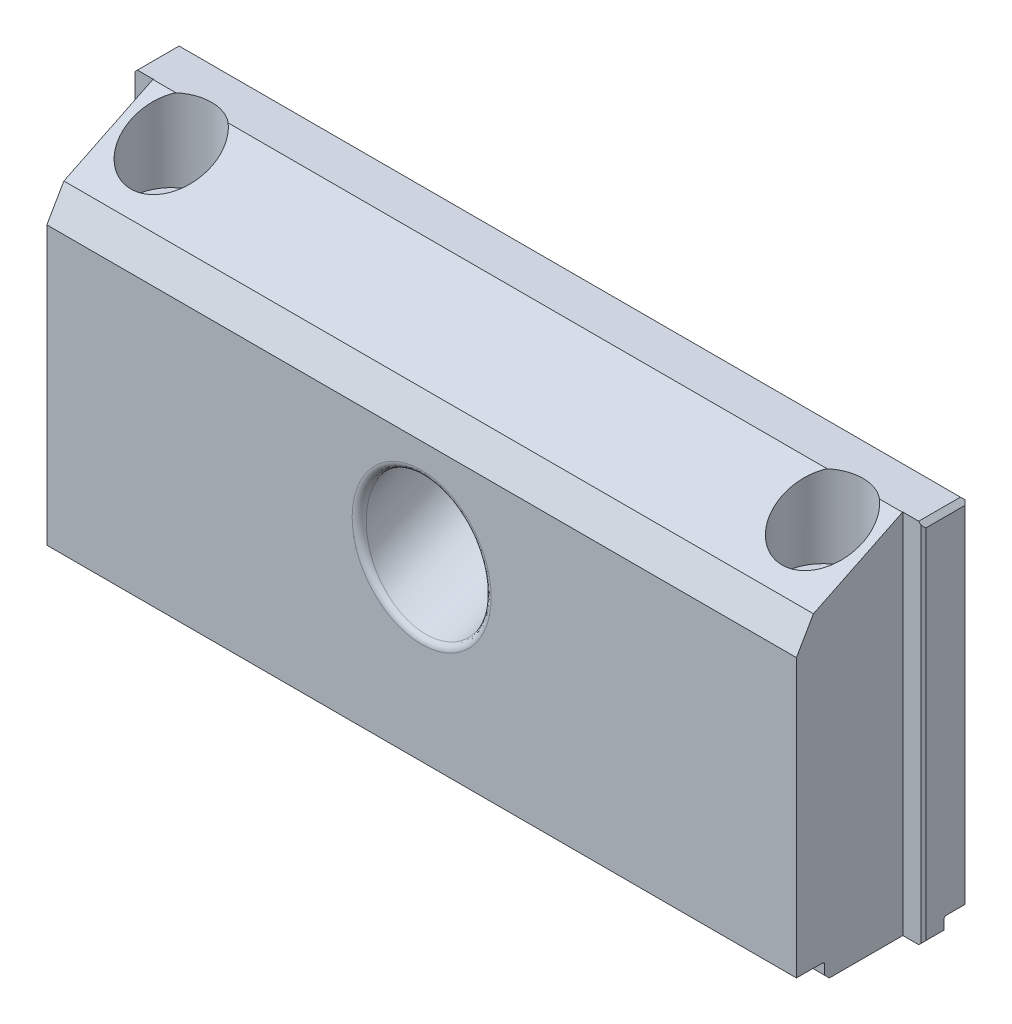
ISO-10303-21;
HEADER;
FILE_DESCRIPTION(('STEP AP214'),'2;1');
FILE_NAME('part.step','',(''),(''),'','','');
FILE_SCHEMA(('AUTOMOTIVE_DESIGN { 1 0 10303 214 1 1 1 1 }'));
ENDSEC;
DATA;
#1=APPLICATION_CONTEXT('core data for automotive mechanical design processes');
#2=APPLICATION_PROTOCOL_DEFINITION('international standard','automotive_design',2000,#1);
#3=PRODUCT_CONTEXT('',#1,'mechanical');
#4=PRODUCT('Part','Part','',(#3));
#5=PRODUCT_RELATED_PRODUCT_CATEGORY('part','',(#4));
#6=PRODUCT_DEFINITION_FORMATION('','',#4);
#7=PRODUCT_DEFINITION_CONTEXT('part definition',#1,'design');
#8=PRODUCT_DEFINITION('design','',#6,#7);
#9=PRODUCT_DEFINITION_SHAPE('','',#8);
#10=(LENGTH_UNIT() NAMED_UNIT(*) SI_UNIT(.MILLI.,.METRE.));
#11=(NAMED_UNIT(*) PLANE_ANGLE_UNIT() SI_UNIT($,.RADIAN.));
#12=(NAMED_UNIT(*) SI_UNIT($,.STERADIAN.) SOLID_ANGLE_UNIT());
#13=UNCERTAINTY_MEASURE_WITH_UNIT(LENGTH_MEASURE(1.E-05),#10,'distance_accuracy_value','');
#14=(GEOMETRIC_REPRESENTATION_CONTEXT(3) GLOBAL_UNCERTAINTY_ASSIGNED_CONTEXT((#13)) GLOBAL_UNIT_ASSIGNED_CONTEXT((#10,
#11,#12)) REPRESENTATION_CONTEXT('',''));
#15=CARTESIAN_POINT('',(0.,0.,0.));
#16=DIRECTION('',(0.,0.,1.));
#17=DIRECTION('',(1.,0.,0.));
#18=AXIS2_PLACEMENT_3D('',#15,#16,#17);
#19=CARTESIAN_POINT('',(-11.43,11.43,-8.636));
#20=DIRECTION('',(0.,0.,1.));
#21=DIRECTION('',(1.,0.,0.));
#22=AXIS2_PLACEMENT_3D('',#19,#20,#21);
#23=PLANE('',#22);
#24=CARTESIAN_POINT('',(-11.43,11.43,-8.636));
#25=DIRECTION('',(0.,0.,1.));
#26=DIRECTION('',(1.,0.,0.));
#27=AXIS2_PLACEMENT_3D('',#24,#25,#26);
#28=CIRCLE('',#27,6.35);
#29=CARTESIAN_POINT('',(-5.08,11.43,-8.636));
#30=VERTEX_POINT('',#29);
#31=EDGE_CURVE('E282',#30,#30,#28,.T.);
#32=ORIENTED_EDGE('',*,*,#31,.F.);
#33=EDGE_LOOP('',(#32));
#34=FACE_BOUND('',#33,.T.);
#35=CARTESIAN_POINT('',(-11.43,15.24,-8.636));
#36=DIRECTION('',(0.,0.,1.));
#37=DIRECTION('',(1.,0.,0.));
#38=AXIS2_PLACEMENT_3D('',#35,#36,#37);
#39=CIRCLE('',#38,0.889);
#40=CARTESIAN_POINT('',(-10.541,15.24,-8.636));
#41=VERTEX_POINT('',#40);
#42=EDGE_CURVE('E278',#41,#41,#39,.T.);
#43=ORIENTED_EDGE('',*,*,#42,.T.);
#44=EDGE_LOOP('',(#43));
#45=FACE_BOUND('',#44,.T.);
#46=DIRECTION('',(-0.999999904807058,-0.00043633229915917,0.));
#47=VECTOR('',#46,1.);
#48=CARTESIAN_POINT('',(-12.5221998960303,15.2395234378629,-8.636));
#49=LINE('',#48,#47);
#50=CARTESIAN_POINT('',(-12.5224538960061,15.2395233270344,-8.636));
#51=VERTEX_POINT('',#50);
#52=CARTESIAN_POINT('',(-12.5221998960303,15.2395234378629,-8.636));
#53=VERTEX_POINT('',#52);
#54=EDGE_CURVE('E267',#51,#53,#49,.F.);
#55=ORIENTED_EDGE('',*,*,#54,.F.);
#56=CARTESIAN_POINT('',(-11.43,15.24,-8.636));
#57=DIRECTION('',(0.,0.,-1.));
#58=DIRECTION('',(-1.,0.,0.));
#59=AXIS2_PLACEMENT_3D('',#56,#57,#58);
#60=CIRCLE('',#59,1.092454);
#61=CARTESIAN_POINT('',(-12.522454,15.24,-8.636));
#62=VERTEX_POINT('',#61);
#63=EDGE_CURVE('E1183',#62,#51,#60,.T.);
#64=ORIENTED_EDGE('',*,*,#63,.F.);
#65=DIRECTION('',(-1.,0.,0.));
#66=VECTOR('',#65,1.);
#67=CARTESIAN_POINT('',(-12.5222,15.24,-8.636));
#68=LINE('',#67,#66);
#69=CARTESIAN_POINT('',(-12.5222,15.24,-8.636));
#70=VERTEX_POINT('',#69);
#71=EDGE_CURVE('E30',#62,#70,#68,.F.);
#72=ORIENTED_EDGE('',*,*,#71,.T.);
#73=CARTESIAN_POINT('',(-11.43,15.24,-8.636));
#74=DIRECTION('',(0.,0.,-1.));
#75=DIRECTION('',(-1.,0.,0.));
#76=AXIS2_PLACEMENT_3D('',#73,#74,#75);
#77=CIRCLE('',#76,1.0922);
#78=EDGE_CURVE('E1196',#70,#53,#77,.T.);
#79=ORIENTED_EDGE('',*,*,#78,.T.);
#80=EDGE_LOOP('',(#55,#64,#72,#79));
#81=FACE_BOUND('',#80,.T.);
#82=ADVANCED_FACE('F15',(#34,#45,#81),#23,.F.);
#83=CARTESIAN_POINT('',(189.324718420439,1.778,0.));
#84=DIRECTION('',(0.,1.,0.));
#85=DIRECTION('',(0.,0.,1.));
#86=AXIS2_PLACEMENT_3D('',#83,#84,#85);
#87=PLANE('',#86);
#88=DIRECTION('',(0.,0.,-1.));
#89=VECTOR('',#88,1.);
#90=CARTESIAN_POINT('',(-40.4876,1.778,0.));
#91=LINE('',#90,#89);
#92=CARTESIAN_POINT('',(-40.4876,1.778,0.));
#93=VERTEX_POINT('',#92);
#94=CARTESIAN_POINT('',(-40.4876,1.778,-2.794));
#95=VERTEX_POINT('',#94);
#96=EDGE_CURVE('E298',#93,#95,#91,.T.);
#97=ORIENTED_EDGE('',*,*,#96,.T.);
#98=DIRECTION('',(-1.,0.,0.));
#99=VECTOR('',#98,1.);
#100=CARTESIAN_POINT('',(40.4876,1.778,-2.794));
#101=LINE('',#100,#99);
#102=CARTESIAN_POINT('',(40.4876,1.778,-2.794));
#103=VERTEX_POINT('',#102);
#104=EDGE_CURVE('E582',#95,#103,#101,.F.);
#105=ORIENTED_EDGE('',*,*,#104,.T.);
#106=DIRECTION('',(0.,0.,1.));
#107=VECTOR('',#106,1.);
#108=CARTESIAN_POINT('',(40.4876,1.778,-11.4808));
#109=LINE('',#108,#107);
#110=CARTESIAN_POINT('',(40.4876,1.778,0.));
#111=VERTEX_POINT('',#110);
#112=EDGE_CURVE('E300',#103,#111,#109,.T.);
#113=ORIENTED_EDGE('',*,*,#112,.T.);
#114=DIRECTION('',(-1.,0.,0.));
#115=VECTOR('',#114,1.);
#116=CARTESIAN_POINT('',(189.324718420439,1.778,0.));
#117=LINE('',#116,#115);
#118=EDGE_CURVE('E287',#111,#93,#117,.T.);
#119=ORIENTED_EDGE('',*,*,#118,.T.);
#120=EDGE_LOOP('',(#97,#105,#113,#119));
#121=FACE_BOUND('',#120,.T.);
#122=ADVANCED_FACE('F466',(#121),#87,.F.);
#123=CARTESIAN_POINT('',(189.324718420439,1.778,-3.048));
#124=DIRECTION('',(0.,0.,-1.));
#125=DIRECTION('',(-1.,0.,0.));
#126=AXIS2_PLACEMENT_3D('',#123,#124,#125);
#127=PLANE('',#126);
#128=DIRECTION('',(0.,1.,0.));
#129=VECTOR('',#128,1.);
#130=CARTESIAN_POINT('',(40.4876,37.846,-3.048));
#131=LINE('',#130,#129);
#132=CARTESIAN_POINT('',(40.4876,0.508000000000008,-3.048));
#133=VERTEX_POINT('',#132);
#134=CARTESIAN_POINT('',(40.4876,1.524,-3.048));
#135=VERTEX_POINT('',#134);
#136=EDGE_CURVE('E302',#133,#135,#131,.T.);
#137=ORIENTED_EDGE('',*,*,#136,.T.);
#138=DIRECTION('',(-1.,0.,0.));
#139=VECTOR('',#138,1.);
#140=CARTESIAN_POINT('',(-40.4876,1.524,-3.048));
#141=LINE('',#140,#139);
#142=CARTESIAN_POINT('',(-40.4876,1.524,-3.048));
#143=VERTEX_POINT('',#142);
#144=EDGE_CURVE('E579',#135,#143,#141,.T.);
#145=ORIENTED_EDGE('',*,*,#144,.T.);
#146=DIRECTION('',(0.,-1.,0.));
#147=VECTOR('',#146,1.);
#148=CARTESIAN_POINT('',(-40.4876,37.846,-3.048));
#149=LINE('',#148,#147);
#150=CARTESIAN_POINT('',(-40.4876,0.508,-3.048));
#151=VERTEX_POINT('',#150);
#152=EDGE_CURVE('E333',#143,#151,#149,.T.);
#153=ORIENTED_EDGE('',*,*,#152,.T.);
#154=DIRECTION('',(1.,0.,0.));
#155=VECTOR('',#154,1.);
#156=CARTESIAN_POINT('',(40.4876,0.508,-3.048));
#157=LINE('',#156,#155);
#158=EDGE_CURVE('E527',#151,#133,#157,.T.);
#159=ORIENTED_EDGE('',*,*,#158,.T.);
#160=EDGE_LOOP('',(#137,#145,#153,#159));
#161=FACE_BOUND('',#160,.T.);
#162=ADVANCED_FACE('F423',(#161),#127,.F.);
#163=CARTESIAN_POINT('',(-42.7101,37.846,-11.4808));
#164=DIRECTION('',(-1.,0.,0.));
#165=DIRECTION('',(0.,0.,1.));
#166=AXIS2_PLACEMENT_3D('',#163,#164,#165);
#167=PLANE('',#166);
#168=DIRECTION('',(0.,1.,0.));
#169=VECTOR('',#168,1.);
#170=CARTESIAN_POINT('',(-42.7101,37.846,-11.75004));
#171=LINE('',#170,#169);
#172=CARTESIAN_POINT('',(-42.7101,0.508,-11.75004));
#173=VERTEX_POINT('',#172);
#174=CARTESIAN_POINT('',(-42.7101,39.116,-11.75004));
#175=VERTEX_POINT('',#174);
#176=EDGE_CURVE('E380',#173,#175,#171,.T.);
#177=ORIENTED_EDGE('',*,*,#176,.T.);
#178=DIRECTION('',(0.,0.,-1.));
#179=VECTOR('',#178,1.);
#180=CARTESIAN_POINT('',(-42.7101,39.116,-16.002));
#181=LINE('',#180,#179);
#182=CARTESIAN_POINT('',(-42.7101,39.116,-16.002));
#183=VERTEX_POINT('',#182);
#184=EDGE_CURVE('E570',#175,#183,#181,.T.);
#185=ORIENTED_EDGE('',*,*,#184,.T.);
#186=DIRECTION('',(0.,-1.,0.));
#187=VECTOR('',#186,1.);
#188=CARTESIAN_POINT('',(-42.7101,37.846,-16.002));
#189=LINE('',#188,#187);
#190=CARTESIAN_POINT('',(-42.7101,1.778,-16.002));
#191=VERTEX_POINT('',#190);
#192=EDGE_CURVE('E694',#183,#191,#189,.T.);
#193=ORIENTED_EDGE('',*,*,#192,.T.);
#194=DIRECTION('',(0.,0.,-1.));
#195=VECTOR('',#194,1.);
#196=CARTESIAN_POINT('',(-42.7101,1.778,-11.4808));
#197=LINE('',#196,#195);
#198=CARTESIAN_POINT('',(-42.7101,1.778,-13.97));
#199=VERTEX_POINT('',#198);
#200=EDGE_CURVE('E314',#199,#191,#197,.T.);
#201=ORIENTED_EDGE('',*,*,#200,.F.);
#202=CARTESIAN_POINT('',(-42.7101,1.524,-13.97));
#203=DIRECTION('',(-1.,0.,0.));
#204=DIRECTION('',(0.,0.,1.));
#205=AXIS2_PLACEMENT_3D('',#202,#203,#204);
#206=CIRCLE('',#205,0.254);
#207=CARTESIAN_POINT('',(-42.7101,1.524,-13.716));
#208=VERTEX_POINT('',#207);
#209=EDGE_CURVE('E584',#199,#208,#206,.F.);
#210=ORIENTED_EDGE('',*,*,#209,.T.);
#211=DIRECTION('',(0.,1.,0.));
#212=VECTOR('',#211,1.);
#213=CARTESIAN_POINT('',(-42.7101,37.846,-13.716));
#214=LINE('',#213,#212);
#215=CARTESIAN_POINT('',(-42.7101,0.508,-13.716));
#216=VERTEX_POINT('',#215);
#217=EDGE_CURVE('E318',#216,#208,#214,.T.);
#218=ORIENTED_EDGE('',*,*,#217,.F.);
#219=DIRECTION('',(0.,0.,1.));
#220=VECTOR('',#219,1.);
#221=CARTESIAN_POINT('',(-42.7101,0.508,-11.4808));
#222=LINE('',#221,#220);
#223=EDGE_CURVE('E568',#216,#173,#222,.T.);
#224=ORIENTED_EDGE('',*,*,#223,.T.);
#225=EDGE_LOOP('',(#177,#185,#193,#201,#210,#218,#224));
#226=FACE_BOUND('',#225,.T.);
#227=ADVANCED_FACE('F420',(#226),#167,.T.);
#228=CARTESIAN_POINT('',(42.7101,37.846,-16.256));
#229=DIRECTION('',(1.,0.,0.));
#230=DIRECTION('',(0.,0.,-1.));
#231=AXIS2_PLACEMENT_3D('',#228,#229,#230);
#232=PLANE('',#231);
#233=DIRECTION('',(0.,-1.,0.));
#234=VECTOR('',#233,1.);
#235=CARTESIAN_POINT('',(42.7101,37.846,-11.75004));
#236=LINE('',#235,#234);
#237=CARTESIAN_POINT('',(42.7101,39.116,-11.75004));
#238=VERTEX_POINT('',#237);
#239=CARTESIAN_POINT('',(42.7101,0.508,-11.75004));
#240=VERTEX_POINT('',#239);
#241=EDGE_CURVE('E716',#238,#240,#236,.T.);
#242=ORIENTED_EDGE('',*,*,#241,.T.);
#243=DIRECTION('',(0.,0.,-1.));
#244=VECTOR('',#243,1.);
#245=CARTESIAN_POINT('',(42.7101,0.508,-16.256));
#246=LINE('',#245,#244);
#247=CARTESIAN_POINT('',(42.7101,0.508,-13.716));
#248=VERTEX_POINT('',#247);
#249=EDGE_CURVE('E545',#240,#248,#246,.T.);
#250=ORIENTED_EDGE('',*,*,#249,.T.);
#251=DIRECTION('',(0.,-1.,0.));
#252=VECTOR('',#251,1.);
#253=CARTESIAN_POINT('',(42.7101,37.846,-13.716));
#254=LINE('',#253,#252);
#255=CARTESIAN_POINT('',(42.7101,1.524,-13.716));
#256=VERTEX_POINT('',#255);
#257=EDGE_CURVE('E316',#256,#248,#254,.T.);
#258=ORIENTED_EDGE('',*,*,#257,.F.);
#259=CARTESIAN_POINT('',(42.7101,1.524,-13.97));
#260=DIRECTION('',(1.,0.,0.));
#261=DIRECTION('',(0.,0.,-1.));
#262=AXIS2_PLACEMENT_3D('',#259,#260,#261);
#263=CIRCLE('',#262,0.254);
#264=CARTESIAN_POINT('',(42.7101,1.778,-13.97));
#265=VERTEX_POINT('',#264);
#266=EDGE_CURVE('E586',#256,#265,#263,.F.);
#267=ORIENTED_EDGE('',*,*,#266,.T.);
#268=DIRECTION('',(0.,0.,1.));
#269=VECTOR('',#268,1.);
#270=CARTESIAN_POINT('',(42.7101,1.778,-16.256));
#271=LINE('',#270,#269);
#272=CARTESIAN_POINT('',(42.7101,1.778,-16.002));
#273=VERTEX_POINT('',#272);
#274=EDGE_CURVE('E311',#273,#265,#271,.T.);
#275=ORIENTED_EDGE('',*,*,#274,.F.);
#276=DIRECTION('',(0.,1.,0.));
#277=VECTOR('',#276,1.);
#278=CARTESIAN_POINT('',(42.7101,37.846,-16.002));
#279=LINE('',#278,#277);
#280=CARTESIAN_POINT('',(42.7101,39.116,-16.002));
#281=VERTEX_POINT('',#280);
#282=EDGE_CURVE('E613',#273,#281,#279,.T.);
#283=ORIENTED_EDGE('',*,*,#282,.T.);
#284=DIRECTION('',(0.,0.,1.));
#285=VECTOR('',#284,1.);
#286=CARTESIAN_POINT('',(42.7101,39.116,-11.75004));
#287=LINE('',#286,#285);
#288=EDGE_CURVE('E543',#281,#238,#287,.T.);
#289=ORIENTED_EDGE('',*,*,#288,.T.);
#290=EDGE_LOOP('',(#242,#250,#258,#267,#275,#283,#289));
#291=FACE_BOUND('',#290,.T.);
#292=ADVANCED_FACE('F418',(#291),#232,.T.);
#293=CARTESIAN_POINT('',(40.4876,0.,-11.4808));
#294=DIRECTION('',(0.,-1.,0.));
#295=DIRECTION('',(0.,0.,-1.));
#296=AXIS2_PLACEMENT_3D('',#293,#294,#295);
#297=PLANE('',#296);
#298=DIRECTION('',(0.,0.,1.));
#299=VECTOR('',#298,1.);
#300=CARTESIAN_POINT('',(40.4876,0.,-11.4808));
#301=LINE('',#300,#299);
#302=CARTESIAN_POINT('',(40.4876,0.,-11.49604));
#303=VERTEX_POINT('',#302);
#304=CARTESIAN_POINT('',(40.4876,0.,-3.556));
#305=VERTEX_POINT('',#304);
#306=EDGE_CURVE('E321',#303,#305,#301,.T.);
#307=ORIENTED_EDGE('',*,*,#306,.T.);
#308=DIRECTION('',(-1.,0.,0.));
#309=VECTOR('',#308,1.);
#310=CARTESIAN_POINT('',(-40.4876,0.,-3.556));
#311=LINE('',#310,#309);
#312=CARTESIAN_POINT('',(-40.4876,0.,-3.556));
#313=VERTEX_POINT('',#312);
#314=EDGE_CURVE('E514',#305,#313,#311,.T.);
#315=ORIENTED_EDGE('',*,*,#314,.T.);
#316=DIRECTION('',(0.,0.,-1.));
#317=VECTOR('',#316,1.);
#318=CARTESIAN_POINT('',(-40.4876,0.,0.));
#319=LINE('',#318,#317);
#320=CARTESIAN_POINT('',(-40.4876,0.,-11.49604));
#321=VERTEX_POINT('',#320);
#322=EDGE_CURVE('E322',#313,#321,#319,.T.);
#323=ORIENTED_EDGE('',*,*,#322,.T.);
#324=DIRECTION('',(-1.,0.,0.));
#325=VECTOR('',#324,1.);
#326=CARTESIAN_POINT('',(40.4876,0.,-11.49604));
#327=LINE('',#326,#325);
#328=CARTESIAN_POINT('',(-42.2021,0.,-11.49604));
#329=VERTEX_POINT('',#328);
#330=EDGE_CURVE('E324',#321,#329,#327,.T.);
#331=ORIENTED_EDGE('',*,*,#330,.T.);
#332=DIRECTION('',(0.,0.,-1.));
#333=VECTOR('',#332,1.);
#334=CARTESIAN_POINT('',(-42.2021,0.,-11.4808));
#335=LINE('',#334,#333);
#336=CARTESIAN_POINT('',(-42.2021,0.,-13.208));
#337=VERTEX_POINT('',#336);
#338=EDGE_CURVE('E608',#329,#337,#335,.T.);
#339=ORIENTED_EDGE('',*,*,#338,.T.);
#340=DIRECTION('',(1.,0.,0.));
#341=VECTOR('',#340,1.);
#342=CARTESIAN_POINT('',(42.7101,0.,-13.208));
#343=LINE('',#342,#341);
#344=CARTESIAN_POINT('',(42.2021,0.,-13.208));
#345=VERTEX_POINT('',#344);
#346=EDGE_CURVE('E529',#337,#345,#343,.T.);
#347=ORIENTED_EDGE('',*,*,#346,.T.);
#348=DIRECTION('',(0.,0.,1.));
#349=VECTOR('',#348,1.);
#350=CARTESIAN_POINT('',(42.2021,0.,-11.4808));
#351=LINE('',#350,#349);
#352=CARTESIAN_POINT('',(42.2021,0.,-11.49604));
#353=VERTEX_POINT('',#352);
#354=EDGE_CURVE('E525',#345,#353,#351,.T.);
#355=ORIENTED_EDGE('',*,*,#354,.T.);
#356=DIRECTION('',(-1.,0.,0.));
#357=VECTOR('',#356,1.);
#358=CARTESIAN_POINT('',(40.4876,0.,-11.49604));
#359=LINE('',#358,#357);
#360=EDGE_CURVE('E350',#353,#303,#359,.T.);
#361=ORIENTED_EDGE('',*,*,#360,.T.);
#362=EDGE_LOOP('',(#307,#315,#323,#331,#339,#347,#355,#361));
#363=FACE_BOUND('',#362,.T.);
#364=CARTESIAN_POINT('',(35.179,0.,-8.128));
#365=DIRECTION('',(0.,-1.,0.));
#366=DIRECTION('',(0.,0.,-1.));
#367=AXIS2_PLACEMENT_3D('',#364,#365,#366);
#368=CIRCLE('',#367,2.778125);
#369=CARTESIAN_POINT('',(35.179,0.,-10.906125));
#370=VERTEX_POINT('',#369);
#371=EDGE_CURVE('E367',#370,#370,#368,.T.);
#372=ORIENTED_EDGE('',*,*,#371,.F.);
#373=EDGE_LOOP('',(#372));
#374=FACE_BOUND('',#373,.T.);
#375=CARTESIAN_POINT('',(-35.179,0.,-8.128));
#376=DIRECTION('',(0.,-1.,0.));
#377=DIRECTION('',(0.,0.,-1.));
#378=AXIS2_PLACEMENT_3D('',#375,#376,#377);
#379=CIRCLE('',#378,2.778125);
#380=CARTESIAN_POINT('',(-35.179,0.,-10.906125));
#381=VERTEX_POINT('',#380);
#382=EDGE_CURVE('E286',#381,#381,#379,.T.);
#383=ORIENTED_EDGE('',*,*,#382,.F.);
#384=EDGE_LOOP('',(#383));
#385=FACE_BOUND('',#384,.T.);
#386=ADVANCED_FACE('F439',(#363,#374,#385),#297,.T.);
#387=CARTESIAN_POINT('',(-40.4876,37.846,-11.49604));
#388=DIRECTION('',(0.,0.,1.));
#389=DIRECTION('',(1.,0.,0.));
#390=AXIS2_PLACEMENT_3D('',#387,#388,#389);
#391=PLANE('',#390);
#392=DIRECTION('',(1.,0.,0.));
#393=VECTOR('',#392,1.);
#394=CARTESIAN_POINT('',(-40.4876,39.624,-11.49604));
#395=LINE('',#394,#393);
#396=CARTESIAN_POINT('',(-42.2021,39.624,-11.49604));
#397=VERTEX_POINT('',#396);
#398=CARTESIAN_POINT('',(-40.4876,39.624,-11.49604));
#399=VERTEX_POINT('',#398);
#400=EDGE_CURVE('E307',#397,#399,#395,.T.);
#401=ORIENTED_EDGE('',*,*,#400,.F.);
#402=DIRECTION('',(-0.707106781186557,-0.707106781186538,0.));
#403=VECTOR('',#402,1.);
#404=CARTESIAN_POINT('',(-42.23385,39.59225,-11.49604));
#405=LINE('',#404,#403);
#406=CARTESIAN_POINT('',(-42.4561,39.37,-11.49604));
#407=VERTEX_POINT('',#406);
#408=EDGE_CURVE('E562',#397,#407,#405,.T.);
#409=ORIENTED_EDGE('',*,*,#408,.T.);
#410=DIRECTION('',(0.,-1.,0.));
#411=VECTOR('',#410,1.);
#412=CARTESIAN_POINT('',(-42.4561,37.846,-11.49604));
#413=LINE('',#412,#411);
#414=CARTESIAN_POINT('',(-42.4561,0.253999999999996,-11.49604));
#415=VERTEX_POINT('',#414);
#416=EDGE_CURVE('E711',#407,#415,#413,.T.);
#417=ORIENTED_EDGE('',*,*,#416,.T.);
#418=DIRECTION('',(-0.707106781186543,0.707106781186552,0.));
#419=VECTOR('',#418,1.);
#420=CARTESIAN_POINT('',(-60.26785,18.0657500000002,-11.49604));
#421=LINE('',#420,#419);
#422=EDGE_CURVE('E560',#415,#329,#421,.F.);
#423=ORIENTED_EDGE('',*,*,#422,.T.);
#424=ORIENTED_EDGE('',*,*,#330,.F.);
#425=DIRECTION('',(0.,-1.,0.));
#426=VECTOR('',#425,1.);
#427=CARTESIAN_POINT('',(-40.4876,37.846,-11.49604));
#428=LINE('',#427,#426);
#429=EDGE_CURVE('E330',#399,#321,#428,.T.);
#430=ORIENTED_EDGE('',*,*,#429,.F.);
#431=EDGE_LOOP('',(#401,#409,#417,#423,#424,#430));
#432=FACE_BOUND('',#431,.T.);
#433=ADVANCED_FACE('F416',(#432),#391,.T.);
#434=CARTESIAN_POINT('',(-42.7101,37.846,-16.256));
#435=DIRECTION('',(0.,0.,-1.));
#436=DIRECTION('',(-1.,0.,0.));
#437=AXIS2_PLACEMENT_3D('',#434,#435,#436);
#438=PLANE('',#437);
#439=DIRECTION('',(-1.,0.,0.));
#440=VECTOR('',#439,1.);
#441=CARTESIAN_POINT('',(189.324718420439,1.778,-16.256));
#442=LINE('',#441,#440);
#443=CARTESIAN_POINT('',(42.4561,1.778,-16.256));
#444=VERTEX_POINT('',#443);
#445=CARTESIAN_POINT('',(-42.4561,1.778,-16.256));
#446=VERTEX_POINT('',#445);
#447=EDGE_CURVE('E294',#444,#446,#442,.T.);
#448=ORIENTED_EDGE('',*,*,#447,.T.);
#449=DIRECTION('',(0.,1.,0.));
#450=VECTOR('',#449,1.);
#451=CARTESIAN_POINT('',(-42.4561,37.846,-16.256));
#452=LINE('',#451,#450);
#453=CARTESIAN_POINT('',(-42.4561,39.37,-16.256));
#454=VERTEX_POINT('',#453);
#455=EDGE_CURVE('E708',#446,#454,#452,.T.);
#456=ORIENTED_EDGE('',*,*,#455,.T.);
#457=DIRECTION('',(1.,0.,0.));
#458=VECTOR('',#457,1.);
#459=CARTESIAN_POINT('',(42.7101,39.37,-16.256));
#460=LINE('',#459,#458);
#461=CARTESIAN_POINT('',(42.4561,39.37,-16.256));
#462=VERTEX_POINT('',#461);
#463=EDGE_CURVE('E703',#454,#462,#460,.T.);
#464=ORIENTED_EDGE('',*,*,#463,.T.);
#465=DIRECTION('',(0.,-1.,0.));
#466=VECTOR('',#465,1.);
#467=CARTESIAN_POINT('',(42.4561,37.846,-16.256));
#468=LINE('',#467,#466);
#469=EDGE_CURVE('E706',#462,#444,#468,.T.);
#470=ORIENTED_EDGE('',*,*,#469,.T.);
#471=EDGE_LOOP('',(#448,#456,#464,#470));
#472=FACE_BOUND('',#471,.T.);
#473=CARTESIAN_POINT('',(0.,27.1514190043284,-16.256));
#474=DIRECTION('',(0.,0.,-1.));
#475=DIRECTION('',(0.,-1.,0.));
#476=AXIS2_PLACEMENT_3D('',#473,#474,#475);
#477=ELLIPSE('',#476,8.15389508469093,7.5057);
#478=CARTESIAN_POINT('',(0.,18.9975239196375,-16.256));
#479=VERTEX_POINT('',#478);
#480=EDGE_CURVE('E384',#479,#479,#477,.F.);
#481=ORIENTED_EDGE('',*,*,#480,.T.);
#482=EDGE_LOOP('',(#481));
#483=FACE_BOUND('',#482,.T.);
#484=CARTESIAN_POINT('',(-11.43,11.43,-16.256));
#485=DIRECTION('',(0.,0.,-1.));
#486=DIRECTION('',(-1.,0.,0.));
#487=AXIS2_PLACEMENT_3D('',#484,#485,#486);
#488=CIRCLE('',#487,6.35);
#489=CARTESIAN_POINT('',(-17.78,11.43,-16.256));
#490=VERTEX_POINT('',#489);
#491=EDGE_CURVE('E285',#490,#490,#488,.T.);
#492=ORIENTED_EDGE('',*,*,#491,.F.);
#493=EDGE_LOOP('',(#492));
#494=FACE_BOUND('',#493,.T.);
#495=ADVANCED_FACE('F410',(#472,#483,#494),#438,.T.);
#496=CARTESIAN_POINT('',(42.7101,37.846,-11.49604));
#497=DIRECTION('',(0.,0.,1.));
#498=DIRECTION('',(1.,0.,0.));
#499=AXIS2_PLACEMENT_3D('',#496,#497,#498);
#500=PLANE('',#499);
#501=ORIENTED_EDGE('',*,*,#360,.F.);
#502=DIRECTION('',(-0.707106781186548,-0.707106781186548,0.));
#503=VECTOR('',#502,1.);
#504=CARTESIAN_POINT('',(61.3791,19.177,-11.49604));
#505=LINE('',#504,#503);
#506=CARTESIAN_POINT('',(42.4561,0.254000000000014,-11.49604));
#507=VERTEX_POINT('',#506);
#508=EDGE_CURVE('E537',#353,#507,#505,.F.);
#509=ORIENTED_EDGE('',*,*,#508,.T.);
#510=DIRECTION('',(0.,1.,0.));
#511=VECTOR('',#510,1.);
#512=CARTESIAN_POINT('',(42.4561,37.846,-11.49604));
#513=LINE('',#512,#511);
#514=CARTESIAN_POINT('',(42.4561,39.37,-11.49604));
#515=VERTEX_POINT('',#514);
#516=EDGE_CURVE('E609',#507,#515,#513,.T.);
#517=ORIENTED_EDGE('',*,*,#516,.T.);
#518=DIRECTION('',(-0.707106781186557,0.707106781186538,0.));
#519=VECTOR('',#518,1.);
#520=CARTESIAN_POINT('',(43.3451,38.481,-11.49604));
#521=LINE('',#520,#519);
#522=CARTESIAN_POINT('',(42.2021,39.624,-11.49604));
#523=VERTEX_POINT('',#522);
#524=EDGE_CURVE('E535',#515,#523,#521,.T.);
#525=ORIENTED_EDGE('',*,*,#524,.T.);
#526=DIRECTION('',(1.,0.,0.));
#527=VECTOR('',#526,1.);
#528=CARTESIAN_POINT('',(42.7101,39.624,-11.49604));
#529=LINE('',#528,#527);
#530=CARTESIAN_POINT('',(40.4876,39.624,-11.49604));
#531=VERTEX_POINT('',#530);
#532=EDGE_CURVE('E310',#531,#523,#529,.T.);
#533=ORIENTED_EDGE('',*,*,#532,.F.);
#534=DIRECTION('',(0.,-1.,0.));
#535=VECTOR('',#534,1.);
#536=CARTESIAN_POINT('',(40.4876,37.846,-11.49604));
#537=LINE('',#536,#535);
#538=EDGE_CURVE('E347',#531,#303,#537,.T.);
#539=ORIENTED_EDGE('',*,*,#538,.T.);
#540=EDGE_LOOP('',(#501,#509,#517,#525,#533,#539));
#541=FACE_BOUND('',#540,.T.);
#542=ADVANCED_FACE('F415',(#541),#500,.T.);
#543=CARTESIAN_POINT('',(40.4876,37.846,-11.4808));
#544=DIRECTION('',(1.,0.,0.));
#545=DIRECTION('',(0.,0.,-1.));
#546=AXIS2_PLACEMENT_3D('',#543,#544,#545);
#547=PLANE('',#546);
#548=ORIENTED_EDGE('',*,*,#136,.F.);
#549=DIRECTION('',(0.,-0.707106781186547,-0.707106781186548));
#550=VECTOR('',#549,1.);
#551=CARTESIAN_POINT('',(40.4876,14.9606,11.4046));
#552=LINE('',#551,#550);
#553=EDGE_CURVE('E522',#133,#305,#552,.T.);
#554=ORIENTED_EDGE('',*,*,#553,.T.);
#555=ORIENTED_EDGE('',*,*,#306,.F.);
#556=ORIENTED_EDGE('',*,*,#538,.F.);
#557=DIRECTION('',(0.,0.,-1.));
#558=VECTOR('',#557,1.);
#559=CARTESIAN_POINT('',(40.4876,39.624,-11.4808));
#560=LINE('',#559,#558);
#561=CARTESIAN_POINT('',(40.4876,39.624,-11.4551754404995));
#562=VERTEX_POINT('',#561);
#563=EDGE_CURVE('E308',#562,#531,#560,.T.);
#564=ORIENTED_EDGE('',*,*,#563,.F.);
#565=DIRECTION('',(0.,0.438371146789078,-0.898794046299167));
#566=VECTOR('',#565,1.);
#567=CARTESIAN_POINT('',(40.4876,39.292419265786,-10.7753341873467));
#568=LINE('',#567,#566);
#569=CARTESIAN_POINT('',(40.4876,34.9333433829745,-1.83790415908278));
#570=VERTEX_POINT('',#569);
#571=EDGE_CURVE('E305',#570,#562,#568,.T.);
#572=ORIENTED_EDGE('',*,*,#571,.F.);
#573=DIRECTION('',(0.,-0.866025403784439,0.5));
#574=VECTOR('',#573,1.);
#575=CARTESIAN_POINT('',(40.4876,41.2933322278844,-5.50984543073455));
#576=LINE('',#575,#574);
#577=CARTESIAN_POINT('',(40.4876,31.750000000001,0.));
#578=VERTEX_POINT('',#577);
#579=EDGE_CURVE('E373',#570,#578,#576,.T.);
#580=ORIENTED_EDGE('',*,*,#579,.T.);
#581=DIRECTION('',(0.,-1.,0.));
#582=VECTOR('',#581,1.);
#583=CARTESIAN_POINT('',(40.4876,37.846,0.));
#584=LINE('',#583,#582);
#585=EDGE_CURVE('E329',#578,#111,#584,.T.);
#586=ORIENTED_EDGE('',*,*,#585,.T.);
#587=ORIENTED_EDGE('',*,*,#112,.F.);
#588=CARTESIAN_POINT('',(40.4876,1.524,-2.794));
#589=DIRECTION('',(1.,0.,0.));
#590=DIRECTION('',(0.,0.,-1.));
#591=AXIS2_PLACEMENT_3D('',#588,#589,#590);
#592=CIRCLE('',#591,0.254);
#593=EDGE_CURVE('E9',#103,#135,#592,.F.);
#594=ORIENTED_EDGE('',*,*,#593,.T.);
#595=EDGE_LOOP('',(#548,#554,#555,#556,#564,#572,#580,#586,#587,#594));
#596=FACE_BOUND('',#595,.T.);
#597=ADVANCED_FACE('F428',(#596),#547,.T.);
#598=CARTESIAN_POINT('',(-40.4876,37.846,0.));
#599=DIRECTION('',(-1.,0.,0.));
#600=DIRECTION('',(0.,0.,1.));
#601=AXIS2_PLACEMENT_3D('',#598,#599,#600);
#602=PLANE('',#601);
#603=ORIENTED_EDGE('',*,*,#322,.F.);
#604=DIRECTION('',(0.,0.707106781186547,0.707106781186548));
#605=VECTOR('',#604,1.);
#606=CARTESIAN_POINT('',(-40.4876,20.701,17.145));
#607=LINE('',#606,#605);
#608=EDGE_CURVE('E524',#313,#151,#607,.T.);
#609=ORIENTED_EDGE('',*,*,#608,.T.);
#610=ORIENTED_EDGE('',*,*,#152,.F.);
#611=CARTESIAN_POINT('',(-40.4876,1.524,-2.794));
#612=DIRECTION('',(-1.,0.,0.));
#613=DIRECTION('',(0.,0.,1.));
#614=AXIS2_PLACEMENT_3D('',#611,#612,#613);
#615=CIRCLE('',#614,0.254);
#616=EDGE_CURVE('E23',#143,#95,#615,.F.);
#617=ORIENTED_EDGE('',*,*,#616,.T.);
#618=ORIENTED_EDGE('',*,*,#96,.F.);
#619=DIRECTION('',(0.,-1.,0.));
#620=VECTOR('',#619,1.);
#621=CARTESIAN_POINT('',(-40.4876,37.846,0.));
#622=LINE('',#621,#620);
#623=CARTESIAN_POINT('',(-40.4876,31.750000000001,0.));
#624=VERTEX_POINT('',#623);
#625=EDGE_CURVE('E327',#624,#93,#622,.T.);
#626=ORIENTED_EDGE('',*,*,#625,.F.);
#627=DIRECTION('',(0.,0.866025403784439,-0.5));
#628=VECTOR('',#627,1.);
#629=CARTESIAN_POINT('',(-40.4876,36.322,-2.63964543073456));
#630=LINE('',#629,#628);
#631=CARTESIAN_POINT('',(-40.4876,34.9333433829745,-1.8379041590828));
#632=VERTEX_POINT('',#631);
#633=EDGE_CURVE('E378',#624,#632,#630,.T.);
#634=ORIENTED_EDGE('',*,*,#633,.T.);
#635=DIRECTION('',(0.,-0.438371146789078,0.898794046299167));
#636=VECTOR('',#635,1.);
#637=CARTESIAN_POINT('',(-40.4876,34.7689223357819,-1.5007910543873));
#638=LINE('',#637,#636);
#639=CARTESIAN_POINT('',(-40.4876,39.624,-11.4551754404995));
#640=VERTEX_POINT('',#639);
#641=EDGE_CURVE('E335',#640,#632,#638,.T.);
#642=ORIENTED_EDGE('',*,*,#641,.F.);
#643=DIRECTION('',(0.,0.,1.));
#644=VECTOR('',#643,1.);
#645=CARTESIAN_POINT('',(-40.4876,39.624,0.));
#646=LINE('',#645,#644);
#647=EDGE_CURVE('E338',#399,#640,#646,.T.);
#648=ORIENTED_EDGE('',*,*,#647,.F.);
#649=ORIENTED_EDGE('',*,*,#429,.T.);
#650=EDGE_LOOP('',(#603,#609,#610,#617,#618,#626,#634,#642,#648,#649));
#651=FACE_BOUND('',#650,.T.);
#652=ADVANCED_FACE('F425',(#651),#602,.T.);
#653=CARTESIAN_POINT('',(40.4876,37.846,0.));
#654=DIRECTION('',(0.,0.,1.));
#655=DIRECTION('',(1.,0.,0.));
#656=AXIS2_PLACEMENT_3D('',#653,#654,#655);
#657=PLANE('',#656);
#658=ORIENTED_EDGE('',*,*,#585,.F.);
#659=DIRECTION('',(-1.,0.,0.));
#660=VECTOR('',#659,1.);
#661=CARTESIAN_POINT('',(-40.4876,31.750000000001,0.));
#662=LINE('',#661,#660);
#663=EDGE_CURVE('E376',#578,#624,#662,.T.);
#664=ORIENTED_EDGE('',*,*,#663,.T.);
#665=ORIENTED_EDGE('',*,*,#625,.T.);
#666=ORIENTED_EDGE('',*,*,#118,.F.);
#667=EDGE_LOOP('',(#658,#664,#665,#666));
#668=FACE_BOUND('',#667,.T.);
#669=CARTESIAN_POINT('',(0.,20.8980560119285,0.));
#670=DIRECTION('',(0.,0.,1.));
#671=DIRECTION('',(0.,-1.,0.));
#672=AXIS2_PLACEMENT_3D('',#669,#670,#671);
#673=ELLIPSE('',#672,8.15389508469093,7.5057);
#674=CARTESIAN_POINT('',(0.,12.7441609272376,0.));
#675=VERTEX_POINT('',#674);
#676=EDGE_CURVE('E374',#675,#675,#673,.F.);
#677=ORIENTED_EDGE('',*,*,#676,.T.);
#678=EDGE_LOOP('',(#677));
#679=FACE_BOUND('',#678,.T.);
#680=ADVANCED_FACE('F427',(#668,#679),#657,.T.);
#681=CARTESIAN_POINT('',(189.324718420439,39.624,-11.4551754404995));
#682=DIRECTION('',(0.,-0.898794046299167,-0.438371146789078));
#683=DIRECTION('',(0.,0.438371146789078,-0.898794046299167));
#684=AXIS2_PLACEMENT_3D('',#681,#682,#683);
#685=PLANE('',#684);
#686=ORIENTED_EDGE('',*,*,#641,.T.);
#687=DIRECTION('',(1.,0.,0.));
#688=VECTOR('',#687,1.);
#689=CARTESIAN_POINT('',(40.4876,34.9333433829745,-1.83790415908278));
#690=LINE('',#689,#688);
#691=EDGE_CURVE('E370',#632,#570,#690,.T.);
#692=ORIENTED_EDGE('',*,*,#691,.T.);
#693=ORIENTED_EDGE('',*,*,#571,.T.);
#694=DIRECTION('',(-1.,0.,0.));
#695=VECTOR('',#694,1.);
#696=CARTESIAN_POINT('',(189.324718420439,39.624,-11.4551754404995));
#697=LINE('',#696,#695);
#698=CARTESIAN_POINT('',(38.0054085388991,39.624,-11.4551754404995));
#699=VERTEX_POINT('',#698);
#700=EDGE_CURVE('E291',#562,#699,#697,.T.);
#701=ORIENTED_EDGE('',*,*,#700,.T.);
#702=CARTESIAN_POINT('',(35.179,38.0012281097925,-8.128));
#703=DIRECTION('',(0.,-0.898794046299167,-0.438371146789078));
#704=DIRECTION('',(0.,-0.438371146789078,0.898794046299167));
#705=AXIS2_PLACEMENT_3D('',#702,#703,#704);
#706=ELLIPSE('',#705,4.857202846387,4.365625);
#707=CARTESIAN_POINT('',(32.3525914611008,39.624,-11.4551754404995));
#708=VERTEX_POINT('',#707);
#709=EDGE_CURVE('E366',#699,#708,#706,.T.);
#710=ORIENTED_EDGE('',*,*,#709,.T.);
#711=CARTESIAN_POINT('',(-32.3525914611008,39.624,-11.4551754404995));
#712=VERTEX_POINT('',#711);
#713=EDGE_CURVE('E295',#708,#712,#697,.T.);
#714=ORIENTED_EDGE('',*,*,#713,.T.);
#715=CARTESIAN_POINT('',(-35.179,38.0012281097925,-8.128));
#716=DIRECTION('',(0.,-0.898794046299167,-0.438371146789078));
#717=DIRECTION('',(0.,-0.438371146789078,0.898794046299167));
#718=AXIS2_PLACEMENT_3D('',#715,#716,#717);
#719=ELLIPSE('',#718,4.857202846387,4.365625);
#720=CARTESIAN_POINT('',(-38.0054085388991,39.624,-11.4551754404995));
#721=VERTEX_POINT('',#720);
#722=EDGE_CURVE('E359',#712,#721,#719,.T.);
#723=ORIENTED_EDGE('',*,*,#722,.T.);
#724=EDGE_CURVE('E290',#721,#640,#697,.T.);
#725=ORIENTED_EDGE('',*,*,#724,.T.);
#726=EDGE_LOOP('',(#686,#692,#693,#701,#710,#714,#723,#725));
#727=FACE_BOUND('',#726,.T.);
#728=ADVANCED_FACE('F432',(#727),#685,.F.);
#729=CARTESIAN_POINT('',(189.324718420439,39.624,-16.256));
#730=DIRECTION('',(0.,-1.,0.));
#731=DIRECTION('',(0.,0.,-1.));
#732=AXIS2_PLACEMENT_3D('',#729,#730,#731);
#733=PLANE('',#732);
#734=ORIENTED_EDGE('',*,*,#532,.T.);
#735=DIRECTION('',(0.,0.,-1.));
#736=VECTOR('',#735,1.);
#737=CARTESIAN_POINT('',(42.2021,39.624,-16.002));
#738=LINE('',#737,#736);
#739=CARTESIAN_POINT('',(42.2021,39.624,-16.002));
#740=VERTEX_POINT('',#739);
#741=EDGE_CURVE('E551',#523,#740,#738,.T.);
#742=ORIENTED_EDGE('',*,*,#741,.T.);
#743=DIRECTION('',(-1.,0.,0.));
#744=VECTOR('',#743,1.);
#745=CARTESIAN_POINT('',(-42.7101,39.624,-16.002));
#746=LINE('',#745,#744);
#747=CARTESIAN_POINT('',(-42.2021,39.624,-16.002));
#748=VERTEX_POINT('',#747);
#749=EDGE_CURVE('E713',#740,#748,#746,.T.);
#750=ORIENTED_EDGE('',*,*,#749,.T.);
#751=DIRECTION('',(0.,0.,1.));
#752=VECTOR('',#751,1.);
#753=CARTESIAN_POINT('',(-42.2021,39.624,-11.75004));
#754=LINE('',#753,#752);
#755=EDGE_CURVE('E548',#748,#397,#754,.T.);
#756=ORIENTED_EDGE('',*,*,#755,.T.);
#757=ORIENTED_EDGE('',*,*,#400,.T.);
#758=ORIENTED_EDGE('',*,*,#647,.T.);
#759=ORIENTED_EDGE('',*,*,#724,.F.);
#760=CARTESIAN_POINT('',(-35.179,39.624,-8.128));
#761=DIRECTION('',(0.,-1.,0.));
#762=DIRECTION('',(0.,0.,-1.));
#763=AXIS2_PLACEMENT_3D('',#760,#761,#762);
#764=CIRCLE('',#763,4.365625);
#765=EDGE_CURVE('E341',#721,#712,#764,.T.);
#766=ORIENTED_EDGE('',*,*,#765,.T.);
#767=ORIENTED_EDGE('',*,*,#713,.F.);
#768=CARTESIAN_POINT('',(35.179,39.624,-8.128));
#769=DIRECTION('',(0.,-1.,0.));
#770=DIRECTION('',(0.,0.,-1.));
#771=AXIS2_PLACEMENT_3D('',#768,#769,#770);
#772=CIRCLE('',#771,4.365625);
#773=EDGE_CURVE('E388',#708,#699,#772,.T.);
#774=ORIENTED_EDGE('',*,*,#773,.T.);
#775=ORIENTED_EDGE('',*,*,#700,.F.);
#776=ORIENTED_EDGE('',*,*,#563,.T.);
#777=EDGE_LOOP('',(#734,#742,#750,#756,#757,#758,#759,#766,#767,#774,#775,#776));
#778=FACE_BOUND('',#777,.T.);
#779=ADVANCED_FACE('F493',(#778),#733,.F.);
#780=CARTESIAN_POINT('',(189.324718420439,1.778,-13.716));
#781=DIRECTION('',(0.,1.,0.));
#782=DIRECTION('',(0.,0.,1.));
#783=AXIS2_PLACEMENT_3D('',#780,#781,#782);
#784=PLANE('',#783);
#785=ORIENTED_EDGE('',*,*,#274,.T.);
#786=DIRECTION('',(-1.,0.,0.));
#787=VECTOR('',#786,1.);
#788=CARTESIAN_POINT('',(-42.7101,1.778,-13.97));
#789=LINE('',#788,#787);
#790=EDGE_CURVE('E574',#265,#199,#789,.T.);
#791=ORIENTED_EDGE('',*,*,#790,.T.);
#792=ORIENTED_EDGE('',*,*,#200,.T.);
#793=DIRECTION('',(-0.707106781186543,0.,0.707106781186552));
#794=VECTOR('',#793,1.);
#795=CARTESIAN_POINT('',(-42.7101,1.778,-16.002));
#796=LINE('',#795,#794);
#797=EDGE_CURVE('E701',#191,#446,#796,.F.);
#798=ORIENTED_EDGE('',*,*,#797,.T.);
#799=ORIENTED_EDGE('',*,*,#447,.F.);
#800=DIRECTION('',(-0.707106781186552,0.,-0.707106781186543));
#801=VECTOR('',#800,1.);
#802=CARTESIAN_POINT('',(42.4561,1.778,-16.256));
#803=LINE('',#802,#801);
#804=EDGE_CURVE('E599',#444,#273,#803,.F.);
#805=ORIENTED_EDGE('',*,*,#804,.T.);
#806=EDGE_LOOP('',(#785,#791,#792,#798,#799,#805));
#807=FACE_BOUND('',#806,.T.);
#808=ADVANCED_FACE('F486',(#807),#784,.F.);
#809=CARTESIAN_POINT('',(189.324718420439,0.,-13.716));
#810=DIRECTION('',(0.,0.,1.));
#811=DIRECTION('',(1.,0.,0.));
#812=AXIS2_PLACEMENT_3D('',#809,#810,#811);
#813=PLANE('',#812);
#814=ORIENTED_EDGE('',*,*,#217,.T.);
#815=DIRECTION('',(-1.,0.,0.));
#816=VECTOR('',#815,1.);
#817=CARTESIAN_POINT('',(42.7101,1.524,-13.716));
#818=LINE('',#817,#816);
#819=EDGE_CURVE('E577',#208,#256,#818,.F.);
#820=ORIENTED_EDGE('',*,*,#819,.T.);
#821=ORIENTED_EDGE('',*,*,#257,.T.);
#822=DIRECTION('',(-1.,0.,0.));
#823=VECTOR('',#822,1.);
#824=CARTESIAN_POINT('',(-42.7101,0.508,-13.716));
#825=LINE('',#824,#823);
#826=EDGE_CURVE('E606',#248,#216,#825,.T.);
#827=ORIENTED_EDGE('',*,*,#826,.T.);
#828=EDGE_LOOP('',(#814,#820,#821,#827));
#829=FACE_BOUND('',#828,.T.);
#830=ADVANCED_FACE('F483',(#829),#813,.F.);
#831=CARTESIAN_POINT('',(0.,111.648929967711,-214.557661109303));
#832=DIRECTION('',(0.,-0.390731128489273,0.92050485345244));
#833=DIRECTION('',(0.,-0.92050485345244,-0.390731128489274));
#834=AXIS2_PLACEMENT_3D('',#831,#832,#833);
#835=CYLINDRICAL_SURFACE('',#834,6.7437);
#836=CARTESIAN_POINT('',(0.,27.1514190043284,-15.494));
#837=DIRECTION('',(0.,0.0399196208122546,0.999202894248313));
#838=DIRECTION('',(0.,-0.999202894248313,0.0399196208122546));
#839=AXIS2_PLACEMENT_3D('',#836,#837,#838);
#840=ELLIPSE('',#839,7.45841553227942,6.7437);
#841=CARTESIAN_POINT('',(0.,19.6989486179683,-15.1962628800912));
#842=VERTEX_POINT('',#841);
#843=EDGE_CURVE('E381',#842,#842,#840,.F.);
#844=ORIENTED_EDGE('',*,*,#843,.T.);
#845=EDGE_LOOP('',(#844));
#846=FACE_BOUND('',#845,.T.);
#847=CARTESIAN_POINT('',(0.,20.8980560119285,-0.761999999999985));
#848=DIRECTION('',(0.,-0.0399196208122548,-0.999202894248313));
#849=DIRECTION('',(0.,-0.999202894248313,0.0399196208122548));
#850=AXIS2_PLACEMENT_3D('',#847,#848,#849);
#851=ELLIPSE('',#850,7.45841553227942,6.7437);
#852=CARTESIAN_POINT('',(0.,13.4455856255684,-0.464262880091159));
#853=VERTEX_POINT('',#852);
#854=EDGE_CURVE('E385',#853,#853,#851,.F.);
#855=ORIENTED_EDGE('',*,*,#854,.T.);
#856=EDGE_LOOP('',(#855));
#857=FACE_BOUND('',#856,.T.);
#858=ADVANCED_FACE('F406',(#846,#857),#835,.F.);
#859=CARTESIAN_POINT('',(-11.43,11.43,-254.));
#860=DIRECTION('',(0.,0.,1.));
#861=DIRECTION('',(1.,0.,0.));
#862=AXIS2_PLACEMENT_3D('',#859,#860,#861);
#863=CYLINDRICAL_SURFACE('',#862,6.35);
#864=ORIENTED_EDGE('',*,*,#491,.T.);
#865=EDGE_LOOP('',(#864));
#866=FACE_BOUND('',#865,.T.);
#867=ORIENTED_EDGE('',*,*,#31,.T.);
#868=EDGE_LOOP('',(#867));
#869=FACE_BOUND('',#868,.T.);
#870=ADVANCED_FACE('F455',(#866,#869),#863,.F.);
#871=CARTESIAN_POINT('',(-35.179,254.,-8.128));
#872=DIRECTION('',(0.,-1.,0.));
#873=DIRECTION('',(0.,0.,-1.));
#874=AXIS2_PLACEMENT_3D('',#871,#872,#873);
#875=CYLINDRICAL_SURFACE('',#874,2.778125);
#876=CARTESIAN_POINT('',(-35.179,30.734,-8.128));
#877=DIRECTION('',(0.,-1.,0.));
#878=DIRECTION('',(0.,0.,-1.));
#879=AXIS2_PLACEMENT_3D('',#876,#877,#878);
#880=CIRCLE('',#879,2.778125);
#881=CARTESIAN_POINT('',(-35.179,30.734,-10.906125));
#882=VERTEX_POINT('',#881);
#883=EDGE_CURVE('E356',#882,#882,#880,.F.);
#884=ORIENTED_EDGE('',*,*,#883,.T.);
#885=EDGE_LOOP('',(#884));
#886=FACE_BOUND('',#885,.T.);
#887=ORIENTED_EDGE('',*,*,#382,.T.);
#888=EDGE_LOOP('',(#887));
#889=FACE_BOUND('',#888,.T.);
#890=ADVANCED_FACE('F453',(#886,#889),#875,.F.);
#891=CARTESIAN_POINT('',(-35.179,254.,-8.128));
#892=DIRECTION('',(0.,-1.,0.));
#893=DIRECTION('',(0.,0.,-1.));
#894=AXIS2_PLACEMENT_3D('',#891,#892,#893);
#895=CYLINDRICAL_SURFACE('',#894,4.365625);
#896=CARTESIAN_POINT('',(-35.179,30.734,-8.128));
#897=DIRECTION('',(0.,-1.,0.));
#898=DIRECTION('',(0.,0.,-1.));
#899=AXIS2_PLACEMENT_3D('',#896,#897,#898);
#900=CIRCLE('',#899,4.365625);
#901=CARTESIAN_POINT('',(-35.179,30.734,-12.493625));
#902=VERTEX_POINT('',#901);
#903=EDGE_CURVE('E360',#902,#902,#900,.T.);
#904=ORIENTED_EDGE('',*,*,#903,.T.);
#905=EDGE_LOOP('',(#904));
#906=FACE_BOUND('',#905,.T.);
#907=ORIENTED_EDGE('',*,*,#765,.F.);
#908=ORIENTED_EDGE('',*,*,#722,.F.);
#909=EDGE_LOOP('',(#907,#908));
#910=FACE_BOUND('',#909,.T.);
#911=ADVANCED_FACE('F448',(#906,#910),#895,.F.);
#912=CARTESIAN_POINT('',(-35.179,30.734,-8.128));
#913=DIRECTION('',(0.,-1.,0.));
#914=DIRECTION('',(0.,0.,-1.));
#915=AXIS2_PLACEMENT_3D('',#912,#913,#914);
#916=PLANE('',#915);
#917=ORIENTED_EDGE('',*,*,#903,.F.);
#918=EDGE_LOOP('',(#917));
#919=FACE_BOUND('',#918,.T.);
#920=ORIENTED_EDGE('',*,*,#883,.F.);
#921=EDGE_LOOP('',(#920));
#922=FACE_BOUND('',#921,.T.);
#923=ADVANCED_FACE('F444',(#919,#922),#916,.F.);
#924=CARTESIAN_POINT('',(35.179,254.,-8.128));
#925=DIRECTION('',(0.,-1.,0.));
#926=DIRECTION('',(0.,0.,-1.));
#927=AXIS2_PLACEMENT_3D('',#924,#925,#926);
#928=CYLINDRICAL_SURFACE('',#927,2.778125);
#929=CARTESIAN_POINT('',(35.179,30.734,-8.128));
#930=DIRECTION('',(0.,-1.,0.));
#931=DIRECTION('',(0.,0.,-1.));
#932=AXIS2_PLACEMENT_3D('',#929,#930,#931);
#933=CIRCLE('',#932,2.778125);
#934=CARTESIAN_POINT('',(35.179,30.734,-10.906125));
#935=VERTEX_POINT('',#934);
#936=EDGE_CURVE('E363',#935,#935,#933,.F.);
#937=ORIENTED_EDGE('',*,*,#936,.T.);
#938=EDGE_LOOP('',(#937));
#939=FACE_BOUND('',#938,.T.);
#940=ORIENTED_EDGE('',*,*,#371,.T.);
#941=EDGE_LOOP('',(#940));
#942=FACE_BOUND('',#941,.T.);
#943=ADVANCED_FACE('F447',(#939,#942),#928,.F.);
#944=CARTESIAN_POINT('',(35.179,254.,-8.128));
#945=DIRECTION('',(0.,-1.,0.));
#946=DIRECTION('',(0.,0.,-1.));
#947=AXIS2_PLACEMENT_3D('',#944,#945,#946);
#948=CYLINDRICAL_SURFACE('',#947,4.365625);
#949=CARTESIAN_POINT('',(35.179,30.734,-8.128));
#950=DIRECTION('',(0.,-1.,0.));
#951=DIRECTION('',(0.,0.,-1.));
#952=AXIS2_PLACEMENT_3D('',#949,#950,#951);
#953=CIRCLE('',#952,4.365625);
#954=CARTESIAN_POINT('',(35.179,30.734,-12.493625));
#955=VERTEX_POINT('',#954);
#956=EDGE_CURVE('E281',#955,#955,#953,.T.);
#957=ORIENTED_EDGE('',*,*,#956,.T.);
#958=EDGE_LOOP('',(#957));
#959=FACE_BOUND('',#958,.T.);
#960=ORIENTED_EDGE('',*,*,#773,.F.);
#961=ORIENTED_EDGE('',*,*,#709,.F.);
#962=EDGE_LOOP('',(#960,#961));
#963=FACE_BOUND('',#962,.T.);
#964=ADVANCED_FACE('F17',(#959,#963),#948,.F.);
#965=CARTESIAN_POINT('',(35.179,30.734,-8.128));
#966=DIRECTION('',(0.,-1.,0.));
#967=DIRECTION('',(0.,0.,-1.));
#968=AXIS2_PLACEMENT_3D('',#965,#966,#967);
#969=PLANE('',#968);
#970=ORIENTED_EDGE('',*,*,#956,.F.);
#971=EDGE_LOOP('',(#970));
#972=FACE_BOUND('',#971,.T.);
#973=ORIENTED_EDGE('',*,*,#936,.F.);
#974=EDGE_LOOP('',(#973));
#975=FACE_BOUND('',#974,.T.);
#976=ADVANCED_FACE('F404',(#972,#975),#969,.F.);
#977=CARTESIAN_POINT('',(0.,18.9975239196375,-16.256));
#978=CARTESIAN_POINT('',(0.,20.148780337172,-16.256));
#979=CARTESIAN_POINT('',(0.,19.6989486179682,-15.1962628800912));
#980=CARTESIAN_POINT('',(-0.32766420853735,18.9975239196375,-16.256));
#981=CARTESIAN_POINT('',(-0.273070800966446,20.148780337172,-16.256));
#982=CARTESIAN_POINT('',(-0.294398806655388,19.6989486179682,-15.1962628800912));
#983=CARTESIAN_POINT('',(-0.655328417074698,19.0208912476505,-16.256));
#984=CARTESIAN_POINT('',(-0.545639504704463,20.1666367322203,-16.256));
#985=CARTESIAN_POINT('',(-0.588797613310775,19.7203058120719,-15.1971161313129));
#986=CARTESIAN_POINT('',(-1.30503739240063,19.1138128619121,-16.256));
#987=CARTESIAN_POINT('',(-1.08886649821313,20.2382631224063,-16.256));
#988=CARTESIAN_POINT('',(-1.17254628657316,19.80523400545,-15.2005091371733));
#989=CARTESIAN_POINT('',(-1.62706207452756,19.1835071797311,-16.256));
#990=CARTESIAN_POINT('',(-1.35855376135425,20.2918833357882,-16.256));
#991=CARTESIAN_POINT('',(-1.46187810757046,19.8689329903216,-15.2030540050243));
#992=CARTESIAN_POINT('',(-2.2600114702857,19.3677499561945,-16.256));
#993=CARTESIAN_POINT('',(-1.89278455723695,20.4352423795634,-16.256));
#994=CARTESIAN_POINT('',(-2.03056868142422,20.0373266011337,-15.2097815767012));
#995=CARTESIAN_POINT('',(-2.57086063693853,19.4825572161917,-16.256));
#996=CARTESIAN_POINT('',(-2.15645235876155,20.5246981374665,-16.256));
#997=CARTESIAN_POINT('',(-2.30985955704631,20.1422577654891,-15.2139737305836));
#998=CARTESIAN_POINT('',(-3.17620416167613,19.7549500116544,-16.256));
#999=CARTESIAN_POINT('',(-2.67493856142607,20.7397112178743,-16.256));
#1000=CARTESIAN_POINT('',(-2.85374688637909,20.3912184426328,-15.2239200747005));
#1001=CARTESIAN_POINT('',(-3.47054501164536,19.9128757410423,-16.256));
#1002=CARTESIAN_POINT('',(-2.9290271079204,20.8648819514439,-16.256));
#1003=CARTESIAN_POINT('',(-3.11820541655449,20.5355588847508,-15.2296866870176));
#1004=CARTESIAN_POINT('',(-4.03791846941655,20.2687349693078,-16.256));
#1005=CARTESIAN_POINT('',(-3.42417031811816,21.1508096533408,-16.256));
#1006=CARTESIAN_POINT('',(-3.62797750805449,20.8608059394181,-15.2426807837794));
#1007=CARTESIAN_POINT('',(-4.31071428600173,20.4670449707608,-16.256));
#1008=CARTESIAN_POINT('',(-3.66467551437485,21.3111142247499,-16.256));
#1009=CARTESIAN_POINT('',(-3.87307831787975,21.042056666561,-15.2499220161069));
#1010=CARTESIAN_POINT('',(-4.83041331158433,20.9002591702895,-16.256));
#1011=CARTESIAN_POINT('',(-4.12812197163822,21.6660539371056,-16.256));
#1012=CARTESIAN_POINT('',(-4.34001602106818,21.4380043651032,-15.2657407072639));
#1013=CARTESIAN_POINT('',(-5.07700815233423,21.1355323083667,-16.256));
#1014=CARTESIAN_POINT('',(-4.35071156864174,21.8602106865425,-16.256));
#1015=CARTESIAN_POINT('',(-4.5615758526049,21.6530385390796,-15.2743316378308));
#1016=CARTESIAN_POINT('',(-5.54015267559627,21.6386704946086,-16.256));
#1017=CARTESIAN_POINT('',(-4.77367606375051,22.2807072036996,-16.256));
#1018=CARTESIAN_POINT('',(-4.97770062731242,22.1128951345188,-15.2927035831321));
#1019=CARTESIAN_POINT('',(-5.75634747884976,21.9068613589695,-16.256));
#1020=CARTESIAN_POINT('',(-4.97389940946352,22.5065797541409,-16.256));
#1021=CARTESIAN_POINT('',(-5.1719467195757,22.3580153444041,-15.3024964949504));
#1022=CARTESIAN_POINT('',(-6.15503084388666,22.4713026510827,-16.256));
#1023=CARTESIAN_POINT('',(-5.34761642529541,22.9874244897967,-16.256));
#1024=CARTESIAN_POINT('',(-5.53015461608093,22.8739015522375,-15.3231069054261));
#1025=CARTESIAN_POINT('',(-6.3371509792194,22.7678126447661,-16.256));
#1026=CARTESIAN_POINT('',(-5.52114957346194,23.241972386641,-16.256));
#1027=CARTESIAN_POINT('',(-5.69378539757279,23.1449047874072,-15.3339338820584));
#1028=CARTESIAN_POINT('',(-6.66457199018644,23.3838947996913,-16.256));
#1029=CARTESIAN_POINT('',(-5.83734653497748,23.7761984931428,-16.256));
#1030=CARTESIAN_POINT('',(-5.98796569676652,23.7079895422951,-15.3564299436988));
#1031=CARTESIAN_POINT('',(-6.80952614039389,23.7036507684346,-16.256));
#1032=CARTESIAN_POINT('',(-5.98022439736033,24.0555209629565,-16.256));
#1033=CARTESIAN_POINT('',(-6.1182036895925,24.000239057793,-15.3681057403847));
#1034=CARTESIAN_POINT('',(-7.06010241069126,24.3608352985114,-16.256));
#1035=CARTESIAN_POINT('',(-6.23154127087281,24.6345563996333,-16.256));
#1036=CARTESIAN_POINT('',(-6.34334074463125,24.6008904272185,-15.3921026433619));
#1037=CARTESIAN_POINT('',(-7.16543232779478,24.6983749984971,-16.256));
#1038=CARTESIAN_POINT('',(-6.3403482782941,24.9340024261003,-16.256));
#1039=CARTESIAN_POINT('',(-6.43797726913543,24.9093938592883,-15.4044278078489));
#1040=CARTESIAN_POINT('',(-7.33489334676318,25.385426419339,-16.256));
#1041=CARTESIAN_POINT('',(-6.52066544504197,25.5479266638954,-16.256));
#1042=CARTESIAN_POINT('',(-6.59023412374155,25.5373428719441,-15.4295152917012));
#1043=CARTESIAN_POINT('',(-7.39881375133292,25.7349899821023,-16.256));
#1044=CARTESIAN_POINT('',(-6.59267465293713,25.8622430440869,-16.256));
#1045=CARTESIAN_POINT('',(-6.64766514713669,25.856835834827,-15.4422795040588));
#1046=CARTESIAN_POINT('',(-7.48427218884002,26.440166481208,-16.256));
#1047=CARTESIAN_POINT('',(-6.69734107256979,26.5000973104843,-16.256));
#1048=CARTESIAN_POINT('',(-6.72444760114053,26.5013507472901,-15.4680288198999));
#1049=CARTESIAN_POINT('',(-7.5057,26.7957927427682,-16.256));
#1050=CARTESIAN_POINT('',(-6.73060378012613,26.8235921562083,-16.256));
#1051=CARTESIAN_POINT('',(-6.7437,26.8263848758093,-15.48101440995));
#1052=CARTESIAN_POINT('',(-7.5057,27.5070452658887,-16.256));
#1053=CARTESIAN_POINT('',(-6.75657492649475,27.4737063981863,-16.256));
#1054=CARTESIAN_POINT('',(-6.7437,27.4764531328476,-15.5069855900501));
#1055=CARTESIAN_POINT('',(-7.48427218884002,27.8626715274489,-16.256));
#1056=CARTESIAN_POINT('',(-6.74996854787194,27.8004132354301,-16.256));
#1057=CARTESIAN_POINT('',(-6.72444760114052,27.8014872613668,-15.5199711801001));
#1058=CARTESIAN_POINT('',(-7.39881375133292,28.5678480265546,-16.256));
#1059=CARTESIAN_POINT('',(-6.69587033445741,28.4507269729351,-16.256));
#1060=CARTESIAN_POINT('',(-6.64766514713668,28.4460021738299,-15.5457204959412));
#1061=CARTESIAN_POINT('',(-7.33489334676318,28.9174115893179,-16.256));
#1062=CARTESIAN_POINT('',(-6.64911348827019,28.7745611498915,-16.256));
#1063=CARTESIAN_POINT('',(-6.59023412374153,28.7654951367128,-15.5584847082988));
#1064=CARTESIAN_POINT('',(-7.16543232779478,29.6044630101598,-16.256));
#1065=CARTESIAN_POINT('',(-6.51524854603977,29.4129262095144,-16.256));
#1066=CARTESIAN_POINT('',(-6.4379772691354,29.3934441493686,-15.5835721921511));
#1067=CARTESIAN_POINT('',(-7.06010241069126,29.9420027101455,-16.256));
#1068=CARTESIAN_POINT('',(-6.42889129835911,29.7278298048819,-16.256));
#1069=CARTESIAN_POINT('',(-6.34334074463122,29.7019475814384,-15.5958973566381));
#1070=CARTESIAN_POINT('',(-6.80952614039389,30.5991872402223,-16.256));
#1071=CARTESIAN_POINT('',(-6.21720117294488,30.3422898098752,-16.256));
#1072=CARTESIAN_POINT('',(-6.11820368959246,30.3025989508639,-15.6198942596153));
#1073=CARTESIAN_POINT('',(-6.66457199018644,30.9189432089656,-16.256));
#1074=CARTESIAN_POINT('',(-6.09259660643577,30.6423638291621,-16.256));
#1075=CARTESIAN_POINT('',(-5.98796569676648,30.5948484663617,-15.6315700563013));
#1076=CARTESIAN_POINT('',(-6.3371509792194,31.5350253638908,-16.256));
#1077=CARTESIAN_POINT('',(-5.8065900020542,31.2214090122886,-16.256));
#1078=CARTESIAN_POINT('',(-5.69378539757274,31.1579332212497,-15.6540661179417));
#1079=CARTESIAN_POINT('',(-6.15503084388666,31.8315353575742,-16.256));
#1080=CARTESIAN_POINT('',(-5.64585158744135,31.5010329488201,-16.256));
#1081=CARTESIAN_POINT('',(-5.53015461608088,31.4289364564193,-15.6648930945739));
#1082=CARTESIAN_POINT('',(-5.75634747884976,32.3959766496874,-16.256));
#1083=CARTESIAN_POINT('',(-5.29050579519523,32.033830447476,-16.256));
#1084=CARTESIAN_POINT('',(-5.17194671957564,31.9448226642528,-15.6855035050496));
#1085=CARTESIAN_POINT('',(-5.54015267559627,32.6641675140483,-16.256));
#1086=CARTESIAN_POINT('',(-5.09645368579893,32.2877698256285,-16.256));
#1087=CARTESIAN_POINT('',(-4.97770062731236,32.189942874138,-15.695296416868));
#1088=CARTESIAN_POINT('',(-5.07700815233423,33.1673057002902,-16.256));
#1089=CARTESIAN_POINT('',(-4.67809411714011,32.7643700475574,-16.256));
#1090=CARTESIAN_POINT('',(-4.56157585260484,32.6497994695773,-15.7136683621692));
#1091=CARTESIAN_POINT('',(-4.83041331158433,33.4025788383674,-16.256));
#1092=CARTESIAN_POINT('',(-4.45419245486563,32.9878727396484,-16.256));
#1093=CARTESIAN_POINT('',(-4.34001602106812,32.8648336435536,-15.7222592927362));
#1094=CARTESIAN_POINT('',(-4.31071428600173,33.8357930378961,-16.256));
#1095=CARTESIAN_POINT('',(-3.98035369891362,33.3993922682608,-16.256));
#1096=CARTESIAN_POINT('',(-3.8730783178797,33.2607813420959,-15.7380779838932));
#1097=CARTESIAN_POINT('',(-4.03791846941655,34.0341030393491,-16.256));
#1098=CARTESIAN_POINT('',(-3.73064018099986,33.5882743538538,-16.256));
#1099=CARTESIAN_POINT('',(-3.62797750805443,33.4420320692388,-15.7453192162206));
#1100=CARTESIAN_POINT('',(-3.47054501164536,34.3899622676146,-16.256));
#1101=CARTESIAN_POINT('',(-3.20991103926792,33.9270555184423,-16.256));
#1102=CARTESIAN_POINT('',(-3.11820541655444,33.767279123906,-15.7583133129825));
#1103=CARTESIAN_POINT('',(-3.17620416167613,34.5478879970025,-16.256));
#1104=CARTESIAN_POINT('',(-2.93891924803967,34.0777772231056,-16.256));
#1105=CARTESIAN_POINT('',(-2.85374688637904,33.911619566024,-15.7640799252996));
#1106=CARTESIAN_POINT('',(-2.57086063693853,34.8202807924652,-16.256));
#1107=CARTESIAN_POINT('',(-2.38077362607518,34.3375240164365,-16.256));
#1108=CARTESIAN_POINT('',(-2.30985955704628,34.1605802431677,-15.7740262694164));
#1109=CARTESIAN_POINT('',(-2.26001147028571,34.9350880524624,-16.256));
#1110=CARTESIAN_POINT('',(-2.09344800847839,34.4472557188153,-16.256));
#1111=CARTESIAN_POINT('',(-2.0305686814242,34.2655114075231,-15.7782184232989));
#1112=CARTESIAN_POINT('',(-1.62706207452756,35.1193308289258,-16.256));
#1113=CARTESIAN_POINT('',(-1.50806331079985,34.6231452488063,-16.256));
#1114=CARTESIAN_POINT('',(-1.46187810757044,34.4339050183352,-15.7849459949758));
#1115=CARTESIAN_POINT('',(-1.30503739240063,35.1890251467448,-16.256));
#1116=CARTESIAN_POINT('',(-1.20966643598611,34.6898226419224,-16.256));
#1117=CARTESIAN_POINT('',(-1.17254628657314,34.4976040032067,-15.7874908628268));
#1118=CARTESIAN_POINT('',(-0.6553284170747,35.2819467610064,-16.256));
#1119=CARTESIAN_POINT('',(-0.607731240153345,34.7785908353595,-16.256));
#1120=CARTESIAN_POINT('',(-0.588797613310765,34.5825321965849,-15.7908838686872));
#1121=CARTESIAN_POINT('',(-0.32766420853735,35.3053140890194,-16.256));
#1122=CARTESIAN_POINT('',(-0.303743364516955,34.8009572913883,-16.256));
#1123=CARTESIAN_POINT('',(-0.294398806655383,34.6038893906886,-15.7917371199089));
#1124=CARTESIAN_POINT('',(0.327664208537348,35.3053140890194,-16.256));
#1125=CARTESIAN_POINT('',(0.303743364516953,34.8009572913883,-16.256));
#1126=CARTESIAN_POINT('',(0.294398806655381,34.6038893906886,-15.7917371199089));
#1127=CARTESIAN_POINT('',(0.655328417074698,35.2819467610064,-16.256));
#1128=CARTESIAN_POINT('',(0.607731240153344,34.7785908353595,-16.256));
#1129=CARTESIAN_POINT('',(0.588797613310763,34.5825321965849,-15.7908838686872));
#1130=CARTESIAN_POINT('',(1.30503739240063,35.1890251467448,-16.256));
#1131=CARTESIAN_POINT('',(1.20966643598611,34.6898226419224,-16.256));
#1132=CARTESIAN_POINT('',(1.17254628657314,34.4976040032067,-15.7874908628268));
#1133=CARTESIAN_POINT('',(1.62706207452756,35.1193308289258,-16.256));
#1134=CARTESIAN_POINT('',(1.50806331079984,34.6231452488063,-16.256));
#1135=CARTESIAN_POINT('',(1.46187810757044,34.4339050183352,-15.7849459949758));
#1136=CARTESIAN_POINT('',(2.2600114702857,34.9350880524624,-16.256));
#1137=CARTESIAN_POINT('',(2.09344800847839,34.4472557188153,-16.256));
#1138=CARTESIAN_POINT('',(2.0305686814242,34.2655114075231,-15.7782184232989));
#1139=CARTESIAN_POINT('',(2.57086063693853,34.8202807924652,-16.256));
#1140=CARTESIAN_POINT('',(2.38077362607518,34.3375240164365,-16.256));
#1141=CARTESIAN_POINT('',(2.30985955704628,34.1605802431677,-15.7740262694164));
#1142=CARTESIAN_POINT('',(3.17620416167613,34.5478879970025,-16.256));
#1143=CARTESIAN_POINT('',(2.93891924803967,34.0777772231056,-16.256));
#1144=CARTESIAN_POINT('',(2.85374688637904,33.911619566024,-15.7640799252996));
#1145=CARTESIAN_POINT('',(3.47054501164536,34.3899622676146,-16.256));
#1146=CARTESIAN_POINT('',(3.20991103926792,33.9270555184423,-16.256));
#1147=CARTESIAN_POINT('',(3.11820541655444,33.7672791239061,-15.7583133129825));
#1148=CARTESIAN_POINT('',(4.03791846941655,34.0341030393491,-16.256));
#1149=CARTESIAN_POINT('',(3.73064018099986,33.5882743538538,-16.256));
#1150=CARTESIAN_POINT('',(3.62797750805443,33.4420320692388,-15.7453192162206));
#1151=CARTESIAN_POINT('',(4.31071428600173,33.8357930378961,-16.256));
#1152=CARTESIAN_POINT('',(3.98035369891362,33.3993922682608,-16.256));
#1153=CARTESIAN_POINT('',(3.8730783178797,33.2607813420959,-15.7380779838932));
#1154=CARTESIAN_POINT('',(4.83041331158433,33.4025788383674,-16.256));
#1155=CARTESIAN_POINT('',(4.45419245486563,32.9878727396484,-16.256));
#1156=CARTESIAN_POINT('',(4.34001602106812,32.8648336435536,-15.7222592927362));
#1157=CARTESIAN_POINT('',(5.07700815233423,33.1673057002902,-16.256));
#1158=CARTESIAN_POINT('',(4.67809411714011,32.7643700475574,-16.256));
#1159=CARTESIAN_POINT('',(4.56157585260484,32.6497994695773,-15.7136683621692));
#1160=CARTESIAN_POINT('',(5.54015267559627,32.6641675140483,-16.256));
#1161=CARTESIAN_POINT('',(5.09645368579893,32.2877698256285,-16.256));
#1162=CARTESIAN_POINT('',(4.97770062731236,32.189942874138,-15.695296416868));
#1163=CARTESIAN_POINT('',(5.75634747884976,32.3959766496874,-16.256));
#1164=CARTESIAN_POINT('',(5.29050579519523,32.033830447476,-16.256));
#1165=CARTESIAN_POINT('',(5.17194671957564,31.9448226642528,-15.6855035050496));
#1166=CARTESIAN_POINT('',(6.15503084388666,31.8315353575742,-16.256));
#1167=CARTESIAN_POINT('',(5.64585158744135,31.5010329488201,-16.256));
#1168=CARTESIAN_POINT('',(5.53015461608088,31.4289364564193,-15.6648930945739));
#1169=CARTESIAN_POINT('',(6.3371509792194,31.5350253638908,-16.256));
#1170=CARTESIAN_POINT('',(5.8065900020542,31.2214090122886,-16.256));
#1171=CARTESIAN_POINT('',(5.69378539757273,31.1579332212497,-15.6540661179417));
#1172=CARTESIAN_POINT('',(6.66457199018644,30.9189432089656,-16.256));
#1173=CARTESIAN_POINT('',(6.09259660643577,30.6423638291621,-16.256));
#1174=CARTESIAN_POINT('',(5.98796569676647,30.5948484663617,-15.6315700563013));
#1175=CARTESIAN_POINT('',(6.80952614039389,30.5991872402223,-16.256));
#1176=CARTESIAN_POINT('',(6.21720117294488,30.3422898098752,-16.256));
#1177=CARTESIAN_POINT('',(6.11820368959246,30.3025989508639,-15.6198942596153));
#1178=CARTESIAN_POINT('',(7.06010241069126,29.9420027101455,-16.256));
#1179=CARTESIAN_POINT('',(6.42889129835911,29.7278298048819,-16.256));
#1180=CARTESIAN_POINT('',(6.34334074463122,29.7019475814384,-15.5958973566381));
#1181=CARTESIAN_POINT('',(7.16543232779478,29.6044630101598,-16.256));
#1182=CARTESIAN_POINT('',(6.51524854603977,29.4129262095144,-16.256));
#1183=CARTESIAN_POINT('',(6.4379772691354,29.3934441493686,-15.5835721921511));
#1184=CARTESIAN_POINT('',(7.33489334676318,28.9174115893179,-16.256));
#1185=CARTESIAN_POINT('',(6.64911348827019,28.7745611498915,-16.256));
#1186=CARTESIAN_POINT('',(6.59023412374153,28.7654951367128,-15.5584847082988));
#1187=CARTESIAN_POINT('',(7.39881375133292,28.5678480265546,-16.256));
#1188=CARTESIAN_POINT('',(6.69587033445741,28.4507269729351,-16.256));
#1189=CARTESIAN_POINT('',(6.64766514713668,28.4460021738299,-15.5457204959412));
#1190=CARTESIAN_POINT('',(7.48427218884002,27.8626715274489,-16.256));
#1191=CARTESIAN_POINT('',(6.74996854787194,27.8004132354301,-16.256));
#1192=CARTESIAN_POINT('',(6.72444760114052,27.8014872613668,-15.5199711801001));
#1193=CARTESIAN_POINT('',(7.5057,27.5070452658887,-16.256));
#1194=CARTESIAN_POINT('',(6.75657492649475,27.4737063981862,-16.256));
#1195=CARTESIAN_POINT('',(6.7437,27.4764531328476,-15.5069855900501));
#1196=CARTESIAN_POINT('',(7.5057,26.7957927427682,-16.256));
#1197=CARTESIAN_POINT('',(6.73060378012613,26.8235921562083,-16.256));
#1198=CARTESIAN_POINT('',(6.7437,26.8263848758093,-15.48101440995));
#1199=CARTESIAN_POINT('',(7.48427218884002,26.440166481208,-16.256));
#1200=CARTESIAN_POINT('',(6.6973410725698,26.5000973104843,-16.256));
#1201=CARTESIAN_POINT('',(6.72444760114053,26.5013507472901,-15.4680288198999));
#1202=CARTESIAN_POINT('',(7.39881375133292,25.7349899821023,-16.256));
#1203=CARTESIAN_POINT('',(6.59267465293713,25.8622430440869,-16.256));
#1204=CARTESIAN_POINT('',(6.64766514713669,25.856835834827,-15.4422795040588));
#1205=CARTESIAN_POINT('',(7.33489334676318,25.385426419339,-16.256));
#1206=CARTESIAN_POINT('',(6.52066544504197,25.5479266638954,-16.256));
#1207=CARTESIAN_POINT('',(6.59023412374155,25.5373428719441,-15.4295152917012));
#1208=CARTESIAN_POINT('',(7.16543232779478,24.6983749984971,-16.256));
#1209=CARTESIAN_POINT('',(6.3403482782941,24.9340024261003,-16.256));
#1210=CARTESIAN_POINT('',(6.43797726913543,24.9093938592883,-15.4044278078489));
#1211=CARTESIAN_POINT('',(7.06010241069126,24.3608352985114,-16.256));
#1212=CARTESIAN_POINT('',(6.23154127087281,24.6345563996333,-16.256));
#1213=CARTESIAN_POINT('',(6.34334074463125,24.6008904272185,-15.3921026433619));
#1214=CARTESIAN_POINT('',(6.80952614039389,23.7036507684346,-16.256));
#1215=CARTESIAN_POINT('',(5.98022439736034,24.0555209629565,-16.256));
#1216=CARTESIAN_POINT('',(6.1182036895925,24.000239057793,-15.3681057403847));
#1217=CARTESIAN_POINT('',(6.66457199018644,23.3838947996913,-16.256));
#1218=CARTESIAN_POINT('',(5.83734653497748,23.7761984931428,-16.256));
#1219=CARTESIAN_POINT('',(5.98796569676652,23.7079895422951,-15.3564299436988));
#1220=CARTESIAN_POINT('',(6.3371509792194,22.7678126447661,-16.256));
#1221=CARTESIAN_POINT('',(5.52114957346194,23.241972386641,-16.256));
#1222=CARTESIAN_POINT('',(5.69378539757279,23.1449047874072,-15.3339338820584));
#1223=CARTESIAN_POINT('',(6.15503084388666,22.4713026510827,-16.256));
#1224=CARTESIAN_POINT('',(5.34761642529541,22.9874244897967,-16.256));
#1225=CARTESIAN_POINT('',(5.53015461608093,22.8739015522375,-15.3231069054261));
#1226=CARTESIAN_POINT('',(5.75634747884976,21.9068613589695,-16.256));
#1227=CARTESIAN_POINT('',(4.97389940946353,22.5065797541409,-16.256));
#1228=CARTESIAN_POINT('',(5.17194671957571,22.3580153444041,-15.3024964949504));
#1229=CARTESIAN_POINT('',(5.54015267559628,21.6386704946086,-16.256));
#1230=CARTESIAN_POINT('',(4.77367606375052,22.2807072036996,-16.256));
#1231=CARTESIAN_POINT('',(4.97770062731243,22.1128951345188,-15.2927035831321));
#1232=CARTESIAN_POINT('',(5.07700815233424,21.1355323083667,-16.256));
#1233=CARTESIAN_POINT('',(4.35071156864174,21.8602106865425,-16.256));
#1234=CARTESIAN_POINT('',(4.56157585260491,21.6530385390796,-15.2743316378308));
#1235=CARTESIAN_POINT('',(4.83041331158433,20.9002591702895,-16.256));
#1236=CARTESIAN_POINT('',(4.12812197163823,21.6660539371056,-16.256));
#1237=CARTESIAN_POINT('',(4.34001602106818,21.4380043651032,-15.2657407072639));
#1238=CARTESIAN_POINT('',(4.31071428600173,20.4670449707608,-16.256));
#1239=CARTESIAN_POINT('',(3.66467551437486,21.3111142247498,-16.256));
#1240=CARTESIAN_POINT('',(3.87307831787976,21.042056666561,-15.2499220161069));
#1241=CARTESIAN_POINT('',(4.03791846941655,20.2687349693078,-16.256));
#1242=CARTESIAN_POINT('',(3.42417031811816,21.1508096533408,-16.256));
#1243=CARTESIAN_POINT('',(3.62797750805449,20.8608059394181,-15.2426807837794));
#1244=CARTESIAN_POINT('',(3.47054501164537,19.9128757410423,-16.256));
#1245=CARTESIAN_POINT('',(2.9290271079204,20.8648819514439,-16.256));
#1246=CARTESIAN_POINT('',(3.11820541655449,20.5355588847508,-15.2296866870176));
#1247=CARTESIAN_POINT('',(3.17620416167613,19.7549500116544,-16.256));
#1248=CARTESIAN_POINT('',(2.67493856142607,20.7397112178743,-16.256));
#1249=CARTESIAN_POINT('',(2.85374688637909,20.3912184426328,-15.2239200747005));
#1250=CARTESIAN_POINT('',(2.57086063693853,19.4825572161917,-16.256));
#1251=CARTESIAN_POINT('',(2.15645235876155,20.5246981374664,-16.256));
#1252=CARTESIAN_POINT('',(2.30985955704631,20.1422577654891,-15.2139737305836));
#1253=CARTESIAN_POINT('',(2.26001147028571,19.3677499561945,-16.256));
#1254=CARTESIAN_POINT('',(1.89278455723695,20.4352423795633,-16.256));
#1255=CARTESIAN_POINT('',(2.03056868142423,20.0373266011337,-15.2097815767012));
#1256=CARTESIAN_POINT('',(1.62706207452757,19.1835071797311,-16.256));
#1257=CARTESIAN_POINT('',(1.35855376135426,20.2918833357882,-16.256));
#1258=CARTESIAN_POINT('',(1.46187810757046,19.8689329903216,-15.2030540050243));
#1259=CARTESIAN_POINT('',(1.30503739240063,19.1138128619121,-16.256));
#1260=CARTESIAN_POINT('',(1.08886649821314,20.2382631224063,-16.256));
#1261=CARTESIAN_POINT('',(1.17254628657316,19.80523400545,-15.2005091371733));
#1262=CARTESIAN_POINT('',(0.655328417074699,19.0208912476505,-16.256));
#1263=CARTESIAN_POINT('',(0.545639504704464,20.1666367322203,-16.256));
#1264=CARTESIAN_POINT('',(0.588797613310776,19.7203058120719,-15.1971161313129));
#1265=CARTESIAN_POINT('',(0.327664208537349,18.9975239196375,-16.256));
#1266=CARTESIAN_POINT('',(0.273070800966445,20.148780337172,-16.256));
#1267=CARTESIAN_POINT('',(0.294398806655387,19.6989486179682,-15.1962628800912));
#1268=CARTESIAN_POINT('',(0.,18.9975239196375,-16.256));
#1269=CARTESIAN_POINT('',(0.,20.148780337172,-16.256));
#1270=CARTESIAN_POINT('',(0.,19.6989486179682,-15.1962628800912));
#1271=(BOUNDED_SURFACE() B_SPLINE_SURFACE(3,2,((#977,#978,#979),(#980,#981,#982),(#983,#984,
#985),(#986,#987,#988),(#989,#990,#991),(#992,#993,#994),(#995,#996,#997),(#998,#999,#1000),
(#1001,#1002,#1003),(#1004,#1005,#1006),(#1007,#1008,#1009),(#1010,#1011,#1012),(#1013,#1014,
#1015),(#1016,#1017,#1018),(#1019,#1020,#1021),(#1022,#1023,#1024),(#1025,#1026,#1027),(#1028,
#1029,#1030),(#1031,#1032,#1033),(#1034,#1035,#1036),(#1037,#1038,#1039),(#1040,#1041,#1042),
(#1043,#1044,#1045),(#1046,#1047,#1048),(#1049,#1050,#1051),(#1052,#1053,#1054),(#1055,#1056,
#1057),(#1058,#1059,#1060),(#1061,#1062,#1063),(#1064,#1065,#1066),(#1067,#1068,#1069),(#1070,
#1071,#1072),(#1073,#1074,#1075),(#1076,#1077,#1078),(#1079,#1080,#1081),(#1082,#1083,#1084),
(#1085,#1086,#1087),(#1088,#1089,#1090),(#1091,#1092,#1093),(#1094,#1095,#1096),(#1097,#1098,
#1099),(#1100,#1101,#1102),(#1103,#1104,#1105),(#1106,#1107,#1108),(#1109,#1110,#1111),(#1112,
#1113,#1114),(#1115,#1116,#1117),(#1118,#1119,#1120),(#1121,#1122,#1123),(#1124,#1125,#1126),
(#1127,#1128,#1129),(#1130,#1131,#1132),(#1133,#1134,#1135),(#1136,#1137,#1138),(#1139,#1140,
#1141),(#1142,#1143,#1144),(#1145,#1146,#1147),(#1148,#1149,#1150),(#1151,#1152,#1153),(#1154,
#1155,#1156),(#1157,#1158,#1159),(#1160,#1161,#1162),(#1163,#1164,#1165),(#1166,#1167,#1168),
(#1169,#1170,#1171),(#1172,#1173,#1174),(#1175,#1176,#1177),(#1178,#1179,#1180),(#1181,#1182,
#1183),(#1184,#1185,#1186),(#1187,#1188,#1189),(#1190,#1191,#1192),(#1193,#1194,#1195),(#1196,
#1197,#1198),(#1199,#1200,#1201),(#1202,#1203,#1204),(#1205,#1206,#1207),(#1208,#1209,#1210),
(#1211,#1212,#1213),(#1214,#1215,#1216),(#1217,#1218,#1219),(#1220,#1221,#1222),(#1223,#1224,
#1225),(#1226,#1227,#1228),(#1229,#1230,#1231),(#1232,#1233,#1234),(#1235,#1236,#1237),(#1238,
#1239,#1240),(#1241,#1242,#1243),(#1244,#1245,#1246),(#1247,#1248,#1249),(#1250,#1251,#1252),
(#1253,#1254,#1255),(#1256,#1257,#1258),(#1259,#1260,#1261),(#1262,#1263,#1264),(#1265,#1266,
#1267),(#1268,#1269,#1270)),.UNSPECIFIED.,.T.,.F.,.F.) B_SPLINE_SURFACE_WITH_KNOTS((4,2,2,2,2,2,
2,2,2,2,2,2,2,2,2,2,2,2,2,2,2,2,2,2,2,2,2,2,2,2,2,2,2,2,2,2,2,2,2,2,2,2,2,2,2,2,2,2,4),(3,3),
(0.,0.982170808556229,1.96732398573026,2.95821323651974,3.95715829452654,4.96588201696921,
5.98540178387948,7.01597929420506,8.05712626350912,9.10765914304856,10.1657938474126,
11.2292710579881,12.2955032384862,13.3617354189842,14.4252126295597,15.4833473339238,
16.5338802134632,17.5750271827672,18.6056046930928,19.6251244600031,20.6338481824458,
21.6327932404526,22.623682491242,23.6088356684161,24.5910064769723,25.5731772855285,
26.5583304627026,27.549219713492,28.5481647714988,29.5568884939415,30.5764082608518,
31.6069857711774,32.6481327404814,33.6986656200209,34.7568003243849,35.8202775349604,
36.8865097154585,37.9527418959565,39.016219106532,40.074353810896,41.1248866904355,
42.1660336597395,43.1966111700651,44.2161309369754,45.224854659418,46.2237997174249,
47.2146889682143,48.1998421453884,49.1820129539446),(0.,1.),
.UNSPECIFIED.) GEOMETRIC_REPRESENTATION_ITEM() RATIONAL_B_SPLINE_SURFACE(((1.,0.551936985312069,
1.),(1.,0.551936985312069,1.),(1.,0.552444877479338,1.),(1.,0.554456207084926,1.),(1.,
0.555962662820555,1.),(1.,0.559918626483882,1.),(1.,0.562373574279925,1.),(1.,0.568146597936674,
1.),(1.,0.571471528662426,1.),(1.,0.578883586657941,1.),(1.,0.582977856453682,1.),(1.,
0.591813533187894,1.),(1.,0.596561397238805,1.),(1.,0.606581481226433,1.),(1.,0.611858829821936,
1.),(1.,0.62281275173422,1.),(1.,0.628492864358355,1.),(1.,0.640128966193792,1.),(1.,
0.646086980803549,1.),(1.,0.65816026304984,1.),(1.,0.664276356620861,1.),(1.,0.676553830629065,
1.),(1.,0.682715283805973,1.),(1.,0.694979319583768,1.),(1.,0.701081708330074,1.),(1.,
0.713131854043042,1.),(1.,0.719079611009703,1.),(1.,0.730733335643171,1.),(1.,0.736439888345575,
1.),(1.,0.747532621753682,1.),(1.,0.75292026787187,1.),(1.,0.763305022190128,1.),(1.,
0.768304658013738,1.),(1.,0.77785143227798,1.),(1.,0.782402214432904,1.),(1.,0.790997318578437,
1.),(1.,0.795046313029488,1.),(1.,0.802591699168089,1.),(1.,0.806093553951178,1.),(1.,
0.812506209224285,1.),(1.,0.815422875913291,1.),(1.,0.820634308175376,1.),(1.,0.822934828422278,
1.),(1.,0.826890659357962,1.),(1.,0.82855102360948,1.),(1.,0.831210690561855,1.),(1.,
0.832213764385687,1.),(1.,0.833550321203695,1.),(1.,0.833885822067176,1.),(1.,0.833885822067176,
1.),(1.,0.833550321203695,1.),(1.,0.832213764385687,1.),(1.,0.831210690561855,1.),(1.,
0.82855102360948,1.),(1.,0.826890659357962,1.),(1.,0.822934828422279,1.),(1.,0.820634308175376,
1.),(1.,0.815422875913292,1.),(1.,0.812506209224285,1.),(1.,0.806093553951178,1.),(1.,
0.80259169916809,1.),(1.,0.795046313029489,1.),(1.,0.790997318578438,1.),(1.,0.782402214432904,
1.),(1.,0.77785143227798,1.),(1.,0.768304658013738,1.),(1.,0.763305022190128,1.),(1.,
0.752920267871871,1.),(1.,0.747532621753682,1.),(1.,0.736439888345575,1.),(1.,0.730733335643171,
1.),(1.,0.719079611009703,1.),(1.,0.713131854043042,1.),(1.,0.701081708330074,1.),(1.,
0.694979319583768,1.),(1.,0.682715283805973,1.),(1.,0.676553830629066,1.),(1.,0.664276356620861,
1.),(1.,0.658160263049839,1.),(1.,0.646086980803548,1.),(1.,0.640128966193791,1.),(1.,
0.628492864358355,1.),(1.,0.622812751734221,1.),(1.,0.611858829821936,1.),(1.,0.606581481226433,
1.),(1.,0.596561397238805,1.),(1.,0.591813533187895,1.),(1.,0.582977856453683,1.),(1.,
0.578883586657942,1.),(1.,0.571471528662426,1.),(1.,0.568146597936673,1.),(1.,0.562373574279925,
1.),(1.,0.559918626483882,1.),(1.,0.555962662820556,1.),(1.,0.554456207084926,1.),(1.,
0.552444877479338,1.),(1.,0.551936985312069,1.),(1.,0.551936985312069,1.))) REPRESENTATION_ITEM('') SURFACE());
#1272=CARTESIAN_POINT('',(0.,18.9975239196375,-15.494));
#1273=DIRECTION('',(1.,0.,0.));
#1274=DIRECTION('',(0.,0.,-1.));
#1275=AXIS2_PLACEMENT_3D('',#1272,#1273,#1274);
#1276=CIRCLE('',#1275,0.762);
#1277=EDGE_CURVE('',#479,#842,#1276,.T.);
#1278=ORIENTED_EDGE('',*,*,#480,.F.);
#1279=ORIENTED_EDGE('',*,*,#843,.F.);
#1280=ORIENTED_EDGE('',*,*,#1277,.T.);
#1281=ORIENTED_EDGE('',*,*,#1277,.F.);
#1282=EDGE_LOOP('',(#1278,#1280,#1279,#1281));
#1283=FACE_BOUND('',#1282,.T.);
#1284=ADVANCED_FACE('F398',(#1283),#1271,.T.);
#1285=CARTESIAN_POINT('',(0.,12.7441609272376,0.));
#1286=CARTESIAN_POINT('',(0.,13.2485177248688,0.));
#1287=CARTESIAN_POINT('',(0.,13.4455856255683,-0.464262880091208));
#1288=CARTESIAN_POINT('',(0.327664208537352,12.7441609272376,0.));
#1289=CARTESIAN_POINT('',(0.303743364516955,13.2485177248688,0.));
#1290=CARTESIAN_POINT('',(0.294398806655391,13.4455856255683,-0.464262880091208));
#1291=CARTESIAN_POINT('',(0.6553284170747,12.7675282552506,0.));
#1292=CARTESIAN_POINT('',(0.607731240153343,13.2708841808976,0.));
#1293=CARTESIAN_POINT('',(0.588797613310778,13.466942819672,-0.465116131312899));
#1294=CARTESIAN_POINT('',(1.30503739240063,12.8604498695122,0.));
#1295=CARTESIAN_POINT('',(1.20966643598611,13.3596523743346,0.));
#1296=CARTESIAN_POINT('',(1.17254628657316,13.5518710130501,-0.468509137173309));
#1297=CARTESIAN_POINT('',(1.62706207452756,12.9301441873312,0.));
#1298=CARTESIAN_POINT('',(1.50806331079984,13.4263297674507,0.));
#1299=CARTESIAN_POINT('',(1.46187810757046,13.6155699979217,-0.471054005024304));
#1300=CARTESIAN_POINT('',(2.26001147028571,13.1143869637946,0.));
#1301=CARTESIAN_POINT('',(2.09344800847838,13.6022192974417,0.));
#1302=CARTESIAN_POINT('',(2.03056868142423,13.7839636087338,-0.477781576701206));
#1303=CARTESIAN_POINT('',(2.57086063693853,13.2291942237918,0.));
#1304=CARTESIAN_POINT('',(2.38077362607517,13.7119509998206,0.));
#1305=CARTESIAN_POINT('',(2.30985955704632,13.8888947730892,-0.481973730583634));
#1306=CARTESIAN_POINT('',(3.17620416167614,13.5015870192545,0.));
#1307=CARTESIAN_POINT('',(2.93891924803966,13.9716977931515,0.));
#1308=CARTESIAN_POINT('',(2.85374688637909,14.1378554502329,-0.491920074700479));
#1309=CARTESIAN_POINT('',(3.47054501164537,13.6595127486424,0.));
#1310=CARTESIAN_POINT('',(3.20991103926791,14.1224194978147,0.));
#1311=CARTESIAN_POINT('',(3.11820541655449,14.2821958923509,-0.497686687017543));
#1312=CARTESIAN_POINT('',(4.03791846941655,14.0153719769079,0.));
#1313=CARTESIAN_POINT('',(3.73064018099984,14.4612006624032,0.));
#1314=CARTESIAN_POINT('',(3.62797750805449,14.6074429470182,-0.510680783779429));
#1315=CARTESIAN_POINT('',(4.31071428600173,14.2136819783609,0.));
#1316=CARTESIAN_POINT('',(3.9803536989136,14.6500827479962,0.));
#1317=CARTESIAN_POINT('',(3.87307831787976,14.7886936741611,-0.517922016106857));
#1318=CARTESIAN_POINT('',(4.83041331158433,14.6468961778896,0.));
#1319=CARTESIAN_POINT('',(4.45419245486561,15.0616022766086,0.));
#1320=CARTESIAN_POINT('',(4.34001602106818,15.1846413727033,-0.533740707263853));
#1321=CARTESIAN_POINT('',(5.07700815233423,14.8821693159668,0.));
#1322=CARTESIAN_POINT('',(4.67809411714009,15.2851049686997,0.));
#1323=CARTESIAN_POINT('',(4.5615758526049,15.3996755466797,-0.54233163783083));
#1324=CARTESIAN_POINT('',(5.54015267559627,15.3853075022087,0.));
#1325=CARTESIAN_POINT('',(5.09645368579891,15.7617051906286,0.));
#1326=CARTESIAN_POINT('',(4.97770062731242,15.8595321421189,-0.560703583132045));
#1327=CARTESIAN_POINT('',(5.75634747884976,15.6534983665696,0.));
#1328=CARTESIAN_POINT('',(5.29050579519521,16.015644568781,0.));
#1329=CARTESIAN_POINT('',(5.1719467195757,16.1046523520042,-0.570496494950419));
#1330=CARTESIAN_POINT('',(6.15503084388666,16.2179396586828,0.));
#1331=CARTESIAN_POINT('',(5.64585158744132,16.5484420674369,0.));
#1332=CARTESIAN_POINT('',(5.53015461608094,16.6205385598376,-0.591106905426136));
#1333=CARTESIAN_POINT('',(6.3371509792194,16.5144496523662,0.));
#1334=CARTESIAN_POINT('',(5.80659000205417,16.8280660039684,0.));
#1335=CARTESIAN_POINT('',(5.69378539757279,16.8915417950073,-0.60193388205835));
#1336=CARTESIAN_POINT('',(6.66457199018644,17.1305318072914,0.));
#1337=CARTESIAN_POINT('',(6.09259660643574,17.4071111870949,0.));
#1338=CARTESIAN_POINT('',(5.98796569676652,17.4546265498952,-0.62442994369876));
#1339=CARTESIAN_POINT('',(6.80952614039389,17.4502877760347,0.));
#1340=CARTESIAN_POINT('',(6.21720117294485,17.7071852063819,0.));
#1341=CARTESIAN_POINT('',(6.1182036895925,17.7468760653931,-0.63610574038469));
#1342=CARTESIAN_POINT('',(7.06010241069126,18.1074723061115,0.));
#1343=CARTESIAN_POINT('',(6.42889129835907,18.3216452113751,0.));
#1344=CARTESIAN_POINT('',(6.34334074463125,18.3475274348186,-0.660102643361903));
#1345=CARTESIAN_POINT('',(7.16543232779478,18.4450120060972,0.));
#1346=CARTESIAN_POINT('',(6.51524854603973,18.6365488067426,0.));
#1347=CARTESIAN_POINT('',(6.43797726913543,18.6560308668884,-0.672427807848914));
#1348=CARTESIAN_POINT('',(7.33489334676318,19.1320634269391,0.));
#1349=CARTESIAN_POINT('',(6.64911348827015,19.2749138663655,0.));
#1350=CARTESIAN_POINT('',(6.59023412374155,19.2839798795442,-0.697515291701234));
#1351=CARTESIAN_POINT('',(7.39881375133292,19.4816269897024,0.));
#1352=CARTESIAN_POINT('',(6.69587033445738,19.5987480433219,0.));
#1353=CARTESIAN_POINT('',(6.64766514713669,19.6034728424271,-0.710279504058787));
#1354=CARTESIAN_POINT('',(7.48427218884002,20.1868034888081,0.));
#1355=CARTESIAN_POINT('',(6.74996854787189,20.2490617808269,0.));
#1356=CARTESIAN_POINT('',(6.72444760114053,20.2479877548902,-0.736028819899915));
#1357=CARTESIAN_POINT('',(7.5057,20.5424297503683,0.));
#1358=CARTESIAN_POINT('',(6.75657492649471,20.5757686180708,0.));
#1359=CARTESIAN_POINT('',(6.7437,20.5730218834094,-0.749014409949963));
#1360=CARTESIAN_POINT('',(7.5057,21.2536822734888,0.));
#1361=CARTESIAN_POINT('',(6.73060378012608,21.2258828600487,0.));
#1362=CARTESIAN_POINT('',(6.7437,21.2230901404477,-0.774985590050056));
#1363=CARTESIAN_POINT('',(7.48427218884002,21.609308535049,0.));
#1364=CARTESIAN_POINT('',(6.69734107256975,21.5493777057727,0.));
#1365=CARTESIAN_POINT('',(6.72444760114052,21.5481242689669,-0.7879711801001));
#1366=CARTESIAN_POINT('',(7.39881375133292,22.3144850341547,0.));
#1367=CARTESIAN_POINT('',(6.59267465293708,22.1872319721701,0.));
#1368=CARTESIAN_POINT('',(6.64766514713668,22.19263918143,-0.813720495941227));
#1369=CARTESIAN_POINT('',(7.33489334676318,22.664048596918,0.));
#1370=CARTESIAN_POINT('',(6.52066544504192,22.5015483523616,0.));
#1371=CARTESIAN_POINT('',(6.59023412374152,22.5121321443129,-0.826484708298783));
#1372=CARTESIAN_POINT('',(7.16543232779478,23.3511000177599,0.));
#1373=CARTESIAN_POINT('',(6.34034827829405,23.1154725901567,0.));
#1374=CARTESIAN_POINT('',(6.43797726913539,23.1400811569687,-0.851572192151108));
#1375=CARTESIAN_POINT('',(7.06010241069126,23.6886397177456,0.));
#1376=CARTESIAN_POINT('',(6.23154127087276,23.4149186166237,0.));
#1377=CARTESIAN_POINT('',(6.34334074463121,23.4485845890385,-0.863897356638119));
#1378=CARTESIAN_POINT('',(6.80952614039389,24.3458242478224,0.));
#1379=CARTESIAN_POINT('',(5.98022439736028,23.9939540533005,0.));
#1380=CARTESIAN_POINT('',(6.11820368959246,24.049235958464,-0.887894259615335));
#1381=CARTESIAN_POINT('',(6.66457199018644,24.6655802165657,0.));
#1382=CARTESIAN_POINT('',(5.83734653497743,24.2732765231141,0.));
#1383=CARTESIAN_POINT('',(5.98796569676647,24.3414854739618,-0.899570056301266));
#1384=CARTESIAN_POINT('',(6.3371509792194,25.2816623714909,0.));
#1385=CARTESIAN_POINT('',(5.52114957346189,24.8075026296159,0.));
#1386=CARTESIAN_POINT('',(5.69378539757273,24.9045702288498,-0.92206611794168));
#1387=CARTESIAN_POINT('',(6.15503084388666,25.5781723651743,0.));
#1388=CARTESIAN_POINT('',(5.34761642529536,25.0620505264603,0.));
#1389=CARTESIAN_POINT('',(5.53015461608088,25.1755734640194,-0.932893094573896));
#1390=CARTESIAN_POINT('',(5.75634747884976,26.1426136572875,0.));
#1391=CARTESIAN_POINT('',(4.97389940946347,25.5428952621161,0.));
#1392=CARTESIAN_POINT('',(5.17194671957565,25.6914596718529,-0.953503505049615));
#1393=CARTESIAN_POINT('',(5.54015267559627,26.4108045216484,0.));
#1394=CARTESIAN_POINT('',(4.77367606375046,25.7687678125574,0.));
#1395=CARTESIAN_POINT('',(4.97770062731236,25.9365798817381,-0.96329641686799));
#1396=CARTESIAN_POINT('',(5.07700815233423,26.9139427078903,0.));
#1397=CARTESIAN_POINT('',(4.35071156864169,26.1892643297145,0.));
#1398=CARTESIAN_POINT('',(4.56157585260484,26.3964364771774,-0.98166836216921));
#1399=CARTESIAN_POINT('',(4.83041331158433,27.1492158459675,0.));
#1400=CARTESIAN_POINT('',(4.12812197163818,26.3834210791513,0.));
#1401=CARTESIAN_POINT('',(4.34001602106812,26.6114706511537,-0.990259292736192));
#1402=CARTESIAN_POINT('',(4.31071428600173,27.5824300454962,0.));
#1403=CARTESIAN_POINT('',(3.66467551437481,26.7383607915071,0.));
#1404=CARTESIAN_POINT('',(3.8730783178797,27.007418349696,-1.0060779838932));
#1405=CARTESIAN_POINT('',(4.03791846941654,27.7807400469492,0.));
#1406=CARTESIAN_POINT('',(3.42417031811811,26.8986653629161,0.));
#1407=CARTESIAN_POINT('',(3.62797750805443,27.1886690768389,-1.01331921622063));
#1408=CARTESIAN_POINT('',(3.47054501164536,28.1365992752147,0.));
#1409=CARTESIAN_POINT('',(2.92902710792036,27.184593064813,0.));
#1410=CARTESIAN_POINT('',(3.11820541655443,27.5139161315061,-1.02631331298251));
#1411=CARTESIAN_POINT('',(3.17620416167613,28.2945250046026,0.));
#1412=CARTESIAN_POINT('',(2.67493856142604,27.3097637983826,0.));
#1413=CARTESIAN_POINT('',(2.85374688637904,27.6582565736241,-1.03207992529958));
#1414=CARTESIAN_POINT('',(2.57086063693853,28.5669178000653,0.));
#1415=CARTESIAN_POINT('',(2.15645235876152,27.5247768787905,0.));
#1416=CARTESIAN_POINT('',(2.30985955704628,27.9072172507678,-1.04202626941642));
#1417=CARTESIAN_POINT('',(2.2600114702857,28.6817250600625,0.));
#1418=CARTESIAN_POINT('',(1.89278455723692,27.6142326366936,0.));
#1419=CARTESIAN_POINT('',(2.03056868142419,28.0121484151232,-1.04621842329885));
#1420=CARTESIAN_POINT('',(1.62706207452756,28.8659678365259,0.));
#1421=CARTESIAN_POINT('',(1.35855376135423,27.7575916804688,0.));
#1422=CARTESIAN_POINT('',(1.46187810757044,28.1805420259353,-1.05294599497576));
#1423=CARTESIAN_POINT('',(1.30503739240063,28.9356621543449,0.));
#1424=CARTESIAN_POINT('',(1.08886649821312,27.8112118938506,0.));
#1425=CARTESIAN_POINT('',(1.17254628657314,28.2442410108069,-1.05549086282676));
#1426=CARTESIAN_POINT('',(0.655328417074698,29.0285837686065,0.));
#1427=CARTESIAN_POINT('',(0.545639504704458,27.8828382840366,0.));
#1428=CARTESIAN_POINT('',(0.588797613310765,28.329169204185,-1.05888386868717));
#1429=CARTESIAN_POINT('',(0.327664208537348,29.0519510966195,0.));
#1430=CARTESIAN_POINT('',(0.273070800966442,27.9006946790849,0.));
#1431=CARTESIAN_POINT('',(0.294398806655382,28.3505263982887,-1.05973711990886));
#1432=CARTESIAN_POINT('',(-0.327664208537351,29.0519510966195,0.));
#1433=CARTESIAN_POINT('',(-0.273070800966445,27.9006946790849,0.));
#1434=CARTESIAN_POINT('',(-0.294398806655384,28.3505263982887,-1.05973711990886));
#1435=CARTESIAN_POINT('',(-0.6553284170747,29.0285837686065,0.));
#1436=CARTESIAN_POINT('',(-0.54563950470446,27.8828382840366,0.));
#1437=CARTESIAN_POINT('',(-0.588797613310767,28.329169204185,-1.05888386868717));
#1438=CARTESIAN_POINT('',(-1.30503739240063,28.9356621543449,0.));
#1439=CARTESIAN_POINT('',(-1.08886649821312,27.8112118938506,0.));
#1440=CARTESIAN_POINT('',(-1.17254628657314,28.2442410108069,-1.05549086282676));
#1441=CARTESIAN_POINT('',(-1.62706207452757,28.8659678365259,0.));
#1442=CARTESIAN_POINT('',(-1.35855376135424,27.7575916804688,0.));
#1443=CARTESIAN_POINT('',(-1.46187810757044,28.1805420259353,-1.05294599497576));
#1444=CARTESIAN_POINT('',(-2.26001147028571,28.6817250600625,0.));
#1445=CARTESIAN_POINT('',(-1.89278455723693,27.6142326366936,0.));
#1446=CARTESIAN_POINT('',(-2.0305686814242,28.0121484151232,-1.04621842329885));
#1447=CARTESIAN_POINT('',(-2.57086063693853,28.5669178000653,0.));
#1448=CARTESIAN_POINT('',(-2.15645235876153,27.5247768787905,0.));
#1449=CARTESIAN_POINT('',(-2.30985955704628,27.9072172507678,-1.04202626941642));
#1450=CARTESIAN_POINT('',(-3.17620416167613,28.2945250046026,0.));
#1451=CARTESIAN_POINT('',(-2.67493856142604,27.3097637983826,0.));
#1452=CARTESIAN_POINT('',(-2.85374688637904,27.6582565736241,-1.03207992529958));
#1453=CARTESIAN_POINT('',(-3.47054501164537,28.1365992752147,0.));
#1454=CARTESIAN_POINT('',(-2.92902710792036,27.184593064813,0.));
#1455=CARTESIAN_POINT('',(-3.11820541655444,27.5139161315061,-1.02631331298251));
#1456=CARTESIAN_POINT('',(-4.03791846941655,27.7807400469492,0.));
#1457=CARTESIAN_POINT('',(-3.42417031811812,26.8986653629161,0.));
#1458=CARTESIAN_POINT('',(-3.62797750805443,27.1886690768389,-1.01331921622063));
#1459=CARTESIAN_POINT('',(-4.31071428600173,27.5824300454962,0.));
#1460=CARTESIAN_POINT('',(-3.66467551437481,26.7383607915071,0.));
#1461=CARTESIAN_POINT('',(-3.8730783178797,27.007418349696,-1.0060779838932));
#1462=CARTESIAN_POINT('',(-4.83041331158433,27.1492158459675,0.));
#1463=CARTESIAN_POINT('',(-4.12812197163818,26.3834210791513,0.));
#1464=CARTESIAN_POINT('',(-4.34001602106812,26.6114706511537,-0.990259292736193));
#1465=CARTESIAN_POINT('',(-5.07700815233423,26.9139427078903,0.));
#1466=CARTESIAN_POINT('',(-4.35071156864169,26.1892643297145,0.));
#1467=CARTESIAN_POINT('',(-4.56157585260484,26.3964364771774,-0.981668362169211));
#1468=CARTESIAN_POINT('',(-5.54015267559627,26.4108045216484,0.));
#1469=CARTESIAN_POINT('',(-4.77367606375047,25.7687678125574,0.));
#1470=CARTESIAN_POINT('',(-4.97770062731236,25.9365798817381,-0.963296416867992));
#1471=CARTESIAN_POINT('',(-5.75634747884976,26.1426136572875,0.));
#1472=CARTESIAN_POINT('',(-4.97389940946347,25.5428952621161,0.));
#1473=CARTESIAN_POINT('',(-5.17194671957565,25.6914596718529,-0.953503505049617));
#1474=CARTESIAN_POINT('',(-6.15503084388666,25.5781723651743,0.));
#1475=CARTESIAN_POINT('',(-5.34761642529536,25.0620505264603,0.));
#1476=CARTESIAN_POINT('',(-5.53015461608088,25.1755734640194,-0.932893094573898));
#1477=CARTESIAN_POINT('',(-6.3371509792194,25.2816623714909,0.));
#1478=CARTESIAN_POINT('',(-5.52114957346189,24.8075026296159,0.));
#1479=CARTESIAN_POINT('',(-5.69378539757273,24.9045702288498,-0.922066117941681));
#1480=CARTESIAN_POINT('',(-6.66457199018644,24.6655802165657,0.));
#1481=CARTESIAN_POINT('',(-5.83734653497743,24.2732765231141,0.));
#1482=CARTESIAN_POINT('',(-5.98796569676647,24.3414854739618,-0.899570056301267));
#1483=CARTESIAN_POINT('',(-6.80952614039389,24.3458242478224,0.));
#1484=CARTESIAN_POINT('',(-5.98022439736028,23.9939540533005,0.));
#1485=CARTESIAN_POINT('',(-6.11820368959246,24.049235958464,-0.887894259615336));
#1486=CARTESIAN_POINT('',(-7.06010241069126,23.6886397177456,0.));
#1487=CARTESIAN_POINT('',(-6.23154127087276,23.4149186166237,0.));
#1488=CARTESIAN_POINT('',(-6.34334074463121,23.4485845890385,-0.863897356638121));
#1489=CARTESIAN_POINT('',(-7.16543232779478,23.3511000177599,0.));
#1490=CARTESIAN_POINT('',(-6.34034827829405,23.1154725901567,0.));
#1491=CARTESIAN_POINT('',(-6.43797726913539,23.1400811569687,-0.85157219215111));
#1492=CARTESIAN_POINT('',(-7.33489334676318,22.664048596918,0.));
#1493=CARTESIAN_POINT('',(-6.52066544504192,22.5015483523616,0.));
#1494=CARTESIAN_POINT('',(-6.59023412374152,22.5121321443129,-0.826484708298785));
#1495=CARTESIAN_POINT('',(-7.39881375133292,22.3144850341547,0.));
#1496=CARTESIAN_POINT('',(-6.59267465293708,22.1872319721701,0.));
#1497=CARTESIAN_POINT('',(-6.64766514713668,22.19263918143,-0.813720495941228));
#1498=CARTESIAN_POINT('',(-7.48427218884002,21.609308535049,0.));
#1499=CARTESIAN_POINT('',(-6.69734107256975,21.5493777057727,0.));
#1500=CARTESIAN_POINT('',(-6.72444760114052,21.5481242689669,-0.787971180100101));
#1501=CARTESIAN_POINT('',(-7.5057,21.2536822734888,0.));
#1502=CARTESIAN_POINT('',(-6.73060378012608,21.2258828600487,0.));
#1503=CARTESIAN_POINT('',(-6.7437,21.2230901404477,-0.774985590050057));
#1504=CARTESIAN_POINT('',(-7.5057,20.5424297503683,0.));
#1505=CARTESIAN_POINT('',(-6.75657492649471,20.5757686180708,0.));
#1506=CARTESIAN_POINT('',(-6.7437,20.5730218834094,-0.749014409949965));
#1507=CARTESIAN_POINT('',(-7.48427218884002,20.1868034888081,0.));
#1508=CARTESIAN_POINT('',(-6.74996854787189,20.2490617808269,0.));
#1509=CARTESIAN_POINT('',(-6.72444760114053,20.2479877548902,-0.736028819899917));
#1510=CARTESIAN_POINT('',(-7.39881375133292,19.4816269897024,0.));
#1511=CARTESIAN_POINT('',(-6.69587033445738,19.5987480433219,0.));
#1512=CARTESIAN_POINT('',(-6.64766514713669,19.6034728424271,-0.710279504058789));
#1513=CARTESIAN_POINT('',(-7.33489334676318,19.1320634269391,0.));
#1514=CARTESIAN_POINT('',(-6.64911348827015,19.2749138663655,0.));
#1515=CARTESIAN_POINT('',(-6.59023412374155,19.2839798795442,-0.697515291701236));
#1516=CARTESIAN_POINT('',(-7.16543232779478,18.4450120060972,0.));
#1517=CARTESIAN_POINT('',(-6.51524854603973,18.6365488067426,0.));
#1518=CARTESIAN_POINT('',(-6.43797726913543,18.6560308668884,-0.672427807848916));
#1519=CARTESIAN_POINT('',(-7.06010241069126,18.1074723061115,0.));
#1520=CARTESIAN_POINT('',(-6.42889129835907,18.3216452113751,0.));
#1521=CARTESIAN_POINT('',(-6.34334074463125,18.3475274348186,-0.660102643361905));
#1522=CARTESIAN_POINT('',(-6.80952614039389,17.4502877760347,0.));
#1523=CARTESIAN_POINT('',(-6.21720117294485,17.7071852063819,0.));
#1524=CARTESIAN_POINT('',(-6.1182036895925,17.7468760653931,-0.636105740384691));
#1525=CARTESIAN_POINT('',(-6.66457199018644,17.1305318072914,0.));
#1526=CARTESIAN_POINT('',(-6.09259660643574,17.4071111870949,0.));
#1527=CARTESIAN_POINT('',(-5.98796569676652,17.4546265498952,-0.624429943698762));
#1528=CARTESIAN_POINT('',(-6.3371509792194,16.5144496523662,0.));
#1529=CARTESIAN_POINT('',(-5.80659000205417,16.8280660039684,0.));
#1530=CARTESIAN_POINT('',(-5.69378539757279,16.8915417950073,-0.601933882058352));
#1531=CARTESIAN_POINT('',(-6.15503084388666,16.2179396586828,0.));
#1532=CARTESIAN_POINT('',(-5.64585158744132,16.5484420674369,0.));
#1533=CARTESIAN_POINT('',(-5.53015461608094,16.6205385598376,-0.591106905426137));
#1534=CARTESIAN_POINT('',(-5.75634747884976,15.6534983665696,0.));
#1535=CARTESIAN_POINT('',(-5.2905057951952,16.015644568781,0.));
#1536=CARTESIAN_POINT('',(-5.1719467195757,16.1046523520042,-0.570496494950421));
#1537=CARTESIAN_POINT('',(-5.54015267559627,15.3853075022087,0.));
#1538=CARTESIAN_POINT('',(-5.0964536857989,15.7617051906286,0.));
#1539=CARTESIAN_POINT('',(-4.97770062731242,15.8595321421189,-0.560703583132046));
#1540=CARTESIAN_POINT('',(-5.07700815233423,14.8821693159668,0.));
#1541=CARTESIAN_POINT('',(-4.67809411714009,15.2851049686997,0.));
#1542=CARTESIAN_POINT('',(-4.5615758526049,15.3996755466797,-0.542331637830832));
#1543=CARTESIAN_POINT('',(-4.83041331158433,14.6468961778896,0.));
#1544=CARTESIAN_POINT('',(-4.45419245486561,15.0616022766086,0.));
#1545=CARTESIAN_POINT('',(-4.34001602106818,15.1846413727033,-0.533740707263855));
#1546=CARTESIAN_POINT('',(-4.31071428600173,14.2136819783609,0.));
#1547=CARTESIAN_POINT('',(-3.9803536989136,14.6500827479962,0.));
#1548=CARTESIAN_POINT('',(-3.87307831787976,14.7886936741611,-0.517922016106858));
#1549=CARTESIAN_POINT('',(-4.03791846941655,14.0153719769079,0.));
#1550=CARTESIAN_POINT('',(-3.73064018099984,14.4612006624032,0.));
#1551=CARTESIAN_POINT('',(-3.62797750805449,14.6074429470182,-0.51068078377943));
#1552=CARTESIAN_POINT('',(-3.47054501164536,13.6595127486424,0.));
#1553=CARTESIAN_POINT('',(-3.2099110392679,14.1224194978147,0.));
#1554=CARTESIAN_POINT('',(-3.11820541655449,14.2821958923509,-0.497686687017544));
#1555=CARTESIAN_POINT('',(-3.17620416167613,13.5015870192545,0.));
#1556=CARTESIAN_POINT('',(-2.93891924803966,13.9716977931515,0.));
#1557=CARTESIAN_POINT('',(-2.85374688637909,14.1378554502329,-0.491920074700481));
#1558=CARTESIAN_POINT('',(-2.57086063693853,13.2291942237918,0.));
#1559=CARTESIAN_POINT('',(-2.38077362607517,13.7119509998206,0.));
#1560=CARTESIAN_POINT('',(-2.30985955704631,13.8888947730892,-0.481973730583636));
#1561=CARTESIAN_POINT('',(-2.26001147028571,13.1143869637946,0.));
#1562=CARTESIAN_POINT('',(-2.09344800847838,13.6022192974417,0.));
#1563=CARTESIAN_POINT('',(-2.03056868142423,13.7839636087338,-0.477781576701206));
#1564=CARTESIAN_POINT('',(-1.62706207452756,12.9301441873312,0.));
#1565=CARTESIAN_POINT('',(-1.50806331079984,13.4263297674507,0.));
#1566=CARTESIAN_POINT('',(-1.46187810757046,13.6155699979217,-0.471054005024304));
#1567=CARTESIAN_POINT('',(-1.30503739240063,12.8604498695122,0.));
#1568=CARTESIAN_POINT('',(-1.20966643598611,13.3596523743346,0.));
#1569=CARTESIAN_POINT('',(-1.17254628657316,13.5518710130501,-0.46850913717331));
#1570=CARTESIAN_POINT('',(-0.655328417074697,12.7675282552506,0.));
#1571=CARTESIAN_POINT('',(-0.60773124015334,13.2708841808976,0.));
#1572=CARTESIAN_POINT('',(-0.588797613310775,13.466942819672,-0.4651161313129));
#1573=CARTESIAN_POINT('',(-0.327664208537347,12.7441609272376,0.));
#1574=CARTESIAN_POINT('',(-0.30374336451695,13.2485177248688,0.));
#1575=CARTESIAN_POINT('',(-0.294398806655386,13.4455856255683,-0.464262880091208));
#1576=CARTESIAN_POINT('',(0.,12.7441609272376,0.));
#1577=CARTESIAN_POINT('',(0.,13.2485177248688,0.));
#1578=CARTESIAN_POINT('',(0.,13.4455856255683,-0.464262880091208));
#1579=(BOUNDED_SURFACE() B_SPLINE_SURFACE(3,2,((#1285,#1286,#1287),(#1288,#1289,#1290),(#1291,
#1292,#1293),(#1294,#1295,#1296),(#1297,#1298,#1299),(#1300,#1301,#1302),(#1303,#1304,#1305),
(#1306,#1307,#1308),(#1309,#1310,#1311),(#1312,#1313,#1314),(#1315,#1316,#1317),(#1318,#1319,
#1320),(#1321,#1322,#1323),(#1324,#1325,#1326),(#1327,#1328,#1329),(#1330,#1331,#1332),(#1333,
#1334,#1335),(#1336,#1337,#1338),(#1339,#1340,#1341),(#1342,#1343,#1344),(#1345,#1346,#1347),
(#1348,#1349,#1350),(#1351,#1352,#1353),(#1354,#1355,#1356),(#1357,#1358,#1359),(#1360,#1361,
#1362),(#1363,#1364,#1365),(#1366,#1367,#1368),(#1369,#1370,#1371),(#1372,#1373,#1374),(#1375,
#1376,#1377),(#1378,#1379,#1380),(#1381,#1382,#1383),(#1384,#1385,#1386),(#1387,#1388,#1389),
(#1390,#1391,#1392),(#1393,#1394,#1395),(#1396,#1397,#1398),(#1399,#1400,#1401),(#1402,#1403,
#1404),(#1405,#1406,#1407),(#1408,#1409,#1410),(#1411,#1412,#1413),(#1414,#1415,#1416),(#1417,
#1418,#1419),(#1420,#1421,#1422),(#1423,#1424,#1425),(#1426,#1427,#1428),(#1429,#1430,#1431),
(#1432,#1433,#1434),(#1435,#1436,#1437),(#1438,#1439,#1440),(#1441,#1442,#1443),(#1444,#1445,
#1446),(#1447,#1448,#1449),(#1450,#1451,#1452),(#1453,#1454,#1455),(#1456,#1457,#1458),(#1459,
#1460,#1461),(#1462,#1463,#1464),(#1465,#1466,#1467),(#1468,#1469,#1470),(#1471,#1472,#1473),
(#1474,#1475,#1476),(#1477,#1478,#1479),(#1480,#1481,#1482),(#1483,#1484,#1485),(#1486,#1487,
#1488),(#1489,#1490,#1491),(#1492,#1493,#1494),(#1495,#1496,#1497),(#1498,#1499,#1500),(#1501,
#1502,#1503),(#1504,#1505,#1506),(#1507,#1508,#1509),(#1510,#1511,#1512),(#1513,#1514,#1515),
(#1516,#1517,#1518),(#1519,#1520,#1521),(#1522,#1523,#1524),(#1525,#1526,#1527),(#1528,#1529,
#1530),(#1531,#1532,#1533),(#1534,#1535,#1536),(#1537,#1538,#1539),(#1540,#1541,#1542),(#1543,
#1544,#1545),(#1546,#1547,#1548),(#1549,#1550,#1551),(#1552,#1553,#1554),(#1555,#1556,#1557),
(#1558,#1559,#1560),(#1561,#1562,#1563),(#1564,#1565,#1566),(#1567,#1568,#1569),(#1570,#1571,
#1572),(#1573,#1574,#1575),(#1576,#1577,#1578)),.UNSPECIFIED.,.T.,.F.,
.F.) B_SPLINE_SURFACE_WITH_KNOTS((4,2,2,2,2,2,2,2,2,2,2,2,2,2,2,2,2,2,2,2,2,2,2,2,2,2,2,2,2,2,2,
2,2,2,2,2,2,2,2,2,2,2,2,2,2,2,2,2,4),(3,3),(0.,0.982170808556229,1.96732398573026,
2.95821323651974,3.95715829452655,4.96588201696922,5.98540178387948,7.01597929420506,
8.05712626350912,9.10765914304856,10.1657938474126,11.2292710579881,12.2955032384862,
13.3617354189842,14.4252126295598,15.4833473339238,16.5338802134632,17.5750271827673,
18.6056046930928,19.6251244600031,20.6338481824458,21.6327932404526,22.6236824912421,
23.6088356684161,24.5910064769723,25.5731772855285,26.5583304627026,27.5492197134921,
28.5481647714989,29.5568884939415,30.5764082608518,31.6069857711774,32.6481327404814,
33.6986656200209,34.7568003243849,35.8202775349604,36.8865097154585,37.9527418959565,
39.0162191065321,40.0743538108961,41.1248866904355,42.1660336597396,43.1966111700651,
44.2161309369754,45.2248546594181,46.2237997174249,47.2146889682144,48.1998421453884,
49.1820129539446),(0.,1.),
.UNSPECIFIED.) GEOMETRIC_REPRESENTATION_ITEM() RATIONAL_B_SPLINE_SURFACE(((1.,0.83388582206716,
1.),(1.,0.83388582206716,1.),(1.,0.833550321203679,1.),(1.,0.832213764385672,1.),(1.,
0.831210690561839,1.),(1.,0.828551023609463,1.),(1.,0.826890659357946,1.),(1.,0.822934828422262,
1.),(1.,0.82063430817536,1.),(1.,0.815422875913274,1.),(1.,0.812506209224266,1.),(1.,
0.806093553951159,1.),(1.,0.802591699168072,1.),(1.,0.795046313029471,1.),(1.,0.790997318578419,
1.),(1.,0.782402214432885,1.),(1.,0.777851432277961,1.),(1.,0.768304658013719,1.),(1.,
0.76330502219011,1.),(1.,0.752920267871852,1.),(1.,0.747532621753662,1.),(1.,0.736439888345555,
1.),(1.,0.730733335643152,1.),(1.,0.719079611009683,1.),(1.,0.71313185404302,1.),(1.,
0.701081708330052,1.),(1.,0.694979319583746,1.),(1.,0.682715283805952,1.),(1.,0.676553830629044,
1.),(1.,0.664276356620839,1.),(1.,0.658160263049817,1.),(1.,0.646086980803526,1.),(1.,
0.640128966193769,1.),(1.,0.628492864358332,1.),(1.,0.622812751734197,1.),(1.,0.611858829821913,
1.),(1.,0.60658148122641,1.),(1.,0.596561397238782,1.),(1.,0.591813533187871,1.),(1.,
0.582977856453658,1.),(1.,0.578883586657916,1.),(1.,0.571471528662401,1.),(1.,0.568146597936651,
1.),(1.,0.562373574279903,1.),(1.,0.559918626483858,1.),(1.,0.555962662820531,1.),(1.,
0.554456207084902,1.),(1.,0.552444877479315,1.),(1.,0.551936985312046,1.),(1.,0.551936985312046,
1.),(1.,0.552444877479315,1.),(1.,0.554456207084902,1.),(1.,0.555962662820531,1.),(1.,
0.559918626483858,1.),(1.,0.562373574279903,1.),(1.,0.568146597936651,1.),(1.,0.571471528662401,
1.),(1.,0.578883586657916,1.),(1.,0.582977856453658,1.),(1.,0.591813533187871,1.),(1.,
0.596561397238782,1.),(1.,0.60658148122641,1.),(1.,0.611858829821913,1.),(1.,0.622812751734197,
1.),(1.,0.628492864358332,1.),(1.,0.640128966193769,1.),(1.,0.646086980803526,1.),(1.,
0.658160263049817,1.),(1.,0.664276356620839,1.),(1.,0.676553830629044,1.),(1.,0.682715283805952,
1.),(1.,0.694979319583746,1.),(1.,0.701081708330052,1.),(1.,0.71313185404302,1.),(1.,
0.719079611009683,1.),(1.,0.730733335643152,1.),(1.,0.736439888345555,1.),(1.,0.747532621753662,
1.),(1.,0.752920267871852,1.),(1.,0.76330502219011,1.),(1.,0.768304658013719,1.),(1.,
0.777851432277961,1.),(1.,0.782402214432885,1.),(1.,0.790997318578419,1.),(1.,0.795046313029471,
1.),(1.,0.802591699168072,1.),(1.,0.806093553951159,1.),(1.,0.812506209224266,1.),(1.,
0.815422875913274,1.),(1.,0.82063430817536,1.),(1.,0.822934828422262,1.),(1.,0.826890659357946,
1.),(1.,0.828551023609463,1.),(1.,0.831210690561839,1.),(1.,0.832213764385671,1.),(1.,
0.833550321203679,1.),(1.,0.83388582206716,1.),(1.,0.83388582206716,1.))) REPRESENTATION_ITEM('') SURFACE());
#1580=CARTESIAN_POINT('',(0.,12.7441609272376,-0.761999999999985));
#1581=DIRECTION('',(-1.,0.,0.));
#1582=DIRECTION('',(0.,0.,1.));
#1583=AXIS2_PLACEMENT_3D('',#1580,#1581,#1582);
#1584=CIRCLE('',#1583,0.762);
#1585=EDGE_CURVE('',#675,#853,#1584,.T.);
#1586=ORIENTED_EDGE('',*,*,#676,.F.);
#1587=ORIENTED_EDGE('',*,*,#854,.F.);
#1588=ORIENTED_EDGE('',*,*,#1585,.T.);
#1589=ORIENTED_EDGE('',*,*,#1585,.F.);
#1590=EDGE_LOOP('',(#1586,#1588,#1587,#1589));
#1591=FACE_BOUND('',#1590,.T.);
#1592=ADVANCED_FACE('F403',(#1591),#1579,.T.);
#1593=CARTESIAN_POINT('',(-11.43,15.24,-8.636));
#1594=DIRECTION('',(0.,0.,1.));
#1595=DIRECTION('',(1.,0.,0.));
#1596=AXIS2_PLACEMENT_3D('',#1593,#1594,#1595);
#1597=CYLINDRICAL_SURFACE('',#1596,0.889);
#1598=ORIENTED_EDGE('',*,*,#42,.F.);
#1599=EDGE_LOOP('',(#1598));
#1600=FACE_BOUND('',#1599,.T.);
#1601=CARTESIAN_POINT('',(-11.43,15.24,-1.905));
#1602=DIRECTION('',(0.,0.,1.));
#1603=DIRECTION('',(1.,0.,0.));
#1604=AXIS2_PLACEMENT_3D('',#1601,#1602,#1603);
#1605=CIRCLE('',#1604,0.889);
#1606=CARTESIAN_POINT('',(-10.541,15.24,-1.905));
#1607=VERTEX_POINT('',#1606);
#1608=EDGE_CURVE('E275',#1607,#1607,#1605,.T.);
#1609=ORIENTED_EDGE('',*,*,#1608,.T.);
#1610=EDGE_LOOP('',(#1609));
#1611=FACE_BOUND('',#1610,.T.);
#1612=ADVANCED_FACE('F478',(#1600,#1611),#1597,.F.);
#1613=CARTESIAN_POINT('',(189.324718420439,34.9333433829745,-1.83790415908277));
#1614=DIRECTION('',(0.,0.5,0.866025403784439));
#1615=DIRECTION('',(0.,-0.866025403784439,0.5));
#1616=AXIS2_PLACEMENT_3D('',#1613,#1614,#1615);
#1617=PLANE('',#1616);
#1618=ORIENTED_EDGE('',*,*,#633,.F.);
#1619=ORIENTED_EDGE('',*,*,#663,.F.);
#1620=ORIENTED_EDGE('',*,*,#579,.F.);
#1621=ORIENTED_EDGE('',*,*,#691,.F.);
#1622=EDGE_LOOP('',(#1618,#1619,#1620,#1621));
#1623=FACE_BOUND('',#1622,.T.);
#1624=ADVANCED_FACE('F664',(#1623),#1617,.T.);
#1625=CARTESIAN_POINT('',(-11.43,15.24,-1.905));
#1626=DIRECTION('',(0.,0.,-1.));
#1627=DIRECTION('',(-1.,0.,0.));
#1628=AXIS2_PLACEMENT_3D('',#1625,#1626,#1627);
#1629=CONICAL_SURFACE('',#1628,0.889,1.02974425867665);
#1630=ORIENTED_EDGE('',*,*,#1608,.F.);
#1631=EDGE_LOOP('',(#1630));
#1632=FACE_BOUND('',#1631,.T.);
#1633=CARTESIAN_POINT('',(-11.43,15.24,-1.3708349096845));
#1634=VERTEX_POINT('',#1633);
#1635=VERTEX_LOOP('',#1634);
#1636=FACE_BOUND('',#1635,.T.);
#1637=ADVANCED_FACE('F661',(#1632,#1636),#1629,.F.);
#1638=CARTESIAN_POINT('',(42.4561,37.846,-16.256));
#1639=DIRECTION('',(-0.707106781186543,0.,0.707106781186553));
#1640=DIRECTION('',(0.707106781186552,0.,0.707106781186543));
#1641=AXIS2_PLACEMENT_3D('',#1638,#1639,#1640);
#1642=PLANE('',#1641);
#1643=ORIENTED_EDGE('',*,*,#469,.F.);
#1644=DIRECTION('',(-0.577350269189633,0.577350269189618,-0.577350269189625));
#1645=VECTOR('',#1644,1.);
#1646=CARTESIAN_POINT('',(42.9641,38.862,-15.748));
#1647=LINE('',#1646,#1645);
#1648=EDGE_CURVE('E558',#462,#281,#1647,.F.);
#1649=ORIENTED_EDGE('',*,*,#1648,.T.);
#1650=ORIENTED_EDGE('',*,*,#282,.F.);
#1651=ORIENTED_EDGE('',*,*,#804,.F.);
#1652=EDGE_LOOP('',(#1643,#1649,#1650,#1651));
#1653=FACE_BOUND('',#1652,.T.);
#1654=ADVANCED_FACE('F657',(#1653),#1642,.F.);
#1655=CARTESIAN_POINT('',(189.324718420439,39.624,-16.002));
#1656=DIRECTION('',(0.,0.707106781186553,-0.707106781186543));
#1657=DIRECTION('',(0.,0.707106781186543,0.707106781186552));
#1658=AXIS2_PLACEMENT_3D('',#1655,#1656,#1657);
#1659=PLANE('',#1658);
#1660=ORIENTED_EDGE('',*,*,#749,.F.);
#1661=DIRECTION('',(0.577350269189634,-0.577350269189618,-0.577350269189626));
#1662=VECTOR('',#1661,1.);
#1663=CARTESIAN_POINT('',(91.2429728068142,-9.41687280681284,-65.0428728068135));
#1664=LINE('',#1663,#1662);
#1665=EDGE_CURVE('E556',#740,#462,#1664,.T.);
#1666=ORIENTED_EDGE('',*,*,#1665,.T.);
#1667=ORIENTED_EDGE('',*,*,#463,.F.);
#1668=DIRECTION('',(0.577350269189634,0.577350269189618,0.577350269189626));
#1669=VECTOR('',#1668,1.);
#1670=CARTESIAN_POINT('',(34.9735061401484,116.799606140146,61.1736061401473));
#1671=LINE('',#1670,#1669);
#1672=EDGE_CURVE('E554',#454,#748,#1671,.T.);
#1673=ORIENTED_EDGE('',*,*,#1672,.T.);
#1674=EDGE_LOOP('',(#1660,#1666,#1667,#1673));
#1675=FACE_BOUND('',#1674,.T.);
#1676=ADVANCED_FACE('F653',(#1675),#1659,.T.);
#1677=CARTESIAN_POINT('',(-42.7101,37.846,-16.002));
#1678=DIRECTION('',(0.707106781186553,0.,0.707106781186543));
#1679=DIRECTION('',(0.707106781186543,0.,-0.707106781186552));
#1680=AXIS2_PLACEMENT_3D('',#1677,#1678,#1679);
#1681=PLANE('',#1680);
#1682=ORIENTED_EDGE('',*,*,#192,.F.);
#1683=DIRECTION('',(-0.577350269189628,-0.577350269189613,0.577350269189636));
#1684=VECTOR('',#1683,1.);
#1685=CARTESIAN_POINT('',(-43.1334333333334,38.6926666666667,-15.5786666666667));
#1686=LINE('',#1685,#1684);
#1687=EDGE_CURVE('E572',#183,#454,#1686,.F.);
#1688=ORIENTED_EDGE('',*,*,#1687,.T.);
#1689=ORIENTED_EDGE('',*,*,#455,.F.);
#1690=ORIENTED_EDGE('',*,*,#797,.F.);
#1691=EDGE_LOOP('',(#1682,#1688,#1689,#1690));
#1692=FACE_BOUND('',#1691,.T.);
#1693=ADVANCED_FACE('F649',(#1692),#1681,.F.);
#1694=CARTESIAN_POINT('',(-42.4561,37.846,-11.49604));
#1695=DIRECTION('',(0.70710678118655,0.,-0.707106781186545));
#1696=DIRECTION('',(-0.707106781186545,0.,-0.70710678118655));
#1697=AXIS2_PLACEMENT_3D('',#1694,#1695,#1696);
#1698=PLANE('',#1697);
#1699=ORIENTED_EDGE('',*,*,#416,.F.);
#1700=DIRECTION('',(0.57735026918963,0.577350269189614,0.577350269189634));
#1701=VECTOR('',#1700,1.);
#1702=CARTESIAN_POINT('',(-42.9641,38.862,-12.00404));
#1703=LINE('',#1702,#1701);
#1704=EDGE_CURVE('E566',#407,#175,#1703,.F.);
#1705=ORIENTED_EDGE('',*,*,#1704,.T.);
#1706=ORIENTED_EDGE('',*,*,#176,.F.);
#1707=DIRECTION('',(0.577350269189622,-0.57735026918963,0.577350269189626));
#1708=VECTOR('',#1707,1.);
#1709=CARTESIAN_POINT('',(-54.9867666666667,12.7846666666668,-24.0267066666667));
#1710=LINE('',#1709,#1708);
#1711=EDGE_CURVE('E564',#173,#415,#1710,.T.);
#1712=ORIENTED_EDGE('',*,*,#1711,.T.);
#1713=EDGE_LOOP('',(#1699,#1705,#1706,#1712));
#1714=FACE_BOUND('',#1713,.T.);
#1715=ADVANCED_FACE('F645',(#1714),#1698,.F.);
#1716=CARTESIAN_POINT('',(42.7101,37.846,-11.75004));
#1717=DIRECTION('',(-0.707106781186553,0.,-0.707106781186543));
#1718=DIRECTION('',(-0.707106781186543,0.,0.707106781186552));
#1719=AXIS2_PLACEMENT_3D('',#1716,#1717,#1718);
#1720=PLANE('',#1719);
#1721=ORIENTED_EDGE('',*,*,#516,.F.);
#1722=DIRECTION('',(0.577350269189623,0.577350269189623,-0.577350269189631));
#1723=VECTOR('',#1722,1.);
#1724=CARTESIAN_POINT('',(55.1561,12.954,-24.19604));
#1725=LINE('',#1724,#1723);
#1726=EDGE_CURVE('E541',#507,#240,#1725,.T.);
#1727=ORIENTED_EDGE('',*,*,#1726,.T.);
#1728=ORIENTED_EDGE('',*,*,#241,.F.);
#1729=DIRECTION('',(0.577350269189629,-0.577350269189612,-0.577350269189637));
#1730=VECTOR('',#1729,1.);
#1731=CARTESIAN_POINT('',(43.1334333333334,38.6926666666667,-12.1733733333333));
#1732=LINE('',#1731,#1730);
#1733=EDGE_CURVE('E539',#238,#515,#1732,.F.);
#1734=ORIENTED_EDGE('',*,*,#1733,.T.);
#1735=EDGE_LOOP('',(#1721,#1727,#1728,#1734));
#1736=FACE_BOUND('',#1735,.T.);
#1737=ADVANCED_FACE('F642',(#1736),#1720,.F.);
#1738=CARTESIAN_POINT('',(42.2021,0.,-11.4808));
#1739=DIRECTION('',(-0.707106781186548,0.707106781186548,0.));
#1740=DIRECTION('',(-0.707106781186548,-0.707106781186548,0.));
#1741=AXIS2_PLACEMENT_3D('',#1738,#1739,#1740);
#1742=PLANE('',#1741);
#1743=ORIENTED_EDGE('',*,*,#508,.F.);
#1744=ORIENTED_EDGE('',*,*,#354,.F.);
#1745=DIRECTION('',(-0.577350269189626,-0.577350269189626,0.577350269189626));
#1746=VECTOR('',#1745,1.);
#1747=CARTESIAN_POINT('',(41.6263666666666,-0.575733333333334,-12.6322666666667));
#1748=LINE('',#1747,#1746);
#1749=EDGE_CURVE('E272',#248,#345,#1748,.T.);
#1750=ORIENTED_EDGE('',*,*,#1749,.F.);
#1751=ORIENTED_EDGE('',*,*,#249,.F.);
#1752=ORIENTED_EDGE('',*,*,#1726,.F.);
#1753=EDGE_LOOP('',(#1743,#1744,#1750,#1751,#1752));
#1754=FACE_BOUND('',#1753,.T.);
#1755=ADVANCED_FACE('F623',(#1754),#1742,.F.);
#1756=CARTESIAN_POINT('',(-42.2021,0.,-11.4808));
#1757=DIRECTION('',(0.707106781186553,0.707106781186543,0.));
#1758=DIRECTION('',(-0.707106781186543,0.707106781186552,0.));
#1759=AXIS2_PLACEMENT_3D('',#1756,#1757,#1758);
#1760=PLANE('',#1759);
#1761=ORIENTED_EDGE('',*,*,#1711,.F.);
#1762=ORIENTED_EDGE('',*,*,#223,.F.);
#1763=DIRECTION('',(-0.577350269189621,0.577350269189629,-0.577350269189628));
#1764=VECTOR('',#1763,1.);
#1765=CARTESIAN_POINT('',(-41.6263666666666,-0.57573333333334,-12.6322666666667));
#1766=LINE('',#1765,#1764);
#1767=EDGE_CURVE('E270',#337,#216,#1766,.T.);
#1768=ORIENTED_EDGE('',*,*,#1767,.F.);
#1769=ORIENTED_EDGE('',*,*,#338,.F.);
#1770=ORIENTED_EDGE('',*,*,#422,.F.);
#1771=EDGE_LOOP('',(#1761,#1762,#1768,#1769,#1770));
#1772=FACE_BOUND('',#1771,.T.);
#1773=ADVANCED_FACE('F628',(#1772),#1760,.F.);
#1774=CARTESIAN_POINT('',(189.324718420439,0.508,-13.716));
#1775=DIRECTION('',(0.,-0.707106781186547,-0.707106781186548));
#1776=DIRECTION('',(0.,0.707106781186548,-0.707106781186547));
#1777=AXIS2_PLACEMENT_3D('',#1774,#1775,#1776);
#1778=PLANE('',#1777);
#1779=ORIENTED_EDGE('',*,*,#1749,.T.);
#1780=ORIENTED_EDGE('',*,*,#346,.F.);
#1781=ORIENTED_EDGE('',*,*,#1767,.T.);
#1782=ORIENTED_EDGE('',*,*,#826,.F.);
#1783=EDGE_LOOP('',(#1779,#1780,#1781,#1782));
#1784=FACE_BOUND('',#1783,.T.);
#1785=ADVANCED_FACE('F626',(#1784),#1778,.T.);
#1786=CARTESIAN_POINT('',(40.4876,0.,-3.556));
#1787=DIRECTION('',(0.,-0.707106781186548,0.707106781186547));
#1788=DIRECTION('',(0.,-0.707106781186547,-0.707106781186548));
#1789=AXIS2_PLACEMENT_3D('',#1786,#1787,#1788);
#1790=PLANE('',#1789);
#1791=ORIENTED_EDGE('',*,*,#553,.F.);
#1792=ORIENTED_EDGE('',*,*,#158,.F.);
#1793=ORIENTED_EDGE('',*,*,#608,.F.);
#1794=ORIENTED_EDGE('',*,*,#314,.F.);
#1795=EDGE_LOOP('',(#1791,#1792,#1793,#1794));
#1796=FACE_BOUND('',#1795,.T.);
#1797=ADVANCED_FACE('F520',(#1796),#1790,.T.);
#1798=CARTESIAN_POINT('',(42.2021,39.624,-16.256));
#1799=DIRECTION('',(0.707106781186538,0.707106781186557,0.));
#1800=DIRECTION('',(-0.707106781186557,0.707106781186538,0.));
#1801=AXIS2_PLACEMENT_3D('',#1798,#1799,#1800);
#1802=PLANE('',#1801);
#1803=ORIENTED_EDGE('',*,*,#1733,.F.);
#1804=ORIENTED_EDGE('',*,*,#288,.F.);
#1805=ORIENTED_EDGE('',*,*,#1648,.F.);
#1806=ORIENTED_EDGE('',*,*,#1665,.F.);
#1807=ORIENTED_EDGE('',*,*,#741,.F.);
#1808=ORIENTED_EDGE('',*,*,#524,.F.);
#1809=EDGE_LOOP('',(#1803,#1804,#1805,#1806,#1807,#1808));
#1810=FACE_BOUND('',#1809,.T.);
#1811=ADVANCED_FACE('F634',(#1810),#1802,.T.);
#1812=CARTESIAN_POINT('',(-42.2021,39.624,-16.256));
#1813=DIRECTION('',(-0.707106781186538,0.707106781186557,0.));
#1814=DIRECTION('',(-0.707106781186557,-0.707106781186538,0.));
#1815=AXIS2_PLACEMENT_3D('',#1812,#1813,#1814);
#1816=PLANE('',#1815);
#1817=ORIENTED_EDGE('',*,*,#1687,.F.);
#1818=ORIENTED_EDGE('',*,*,#184,.F.);
#1819=ORIENTED_EDGE('',*,*,#1704,.F.);
#1820=ORIENTED_EDGE('',*,*,#408,.F.);
#1821=ORIENTED_EDGE('',*,*,#755,.F.);
#1822=ORIENTED_EDGE('',*,*,#1672,.F.);
#1823=EDGE_LOOP('',(#1817,#1818,#1819,#1820,#1821,#1822));
#1824=FACE_BOUND('',#1823,.T.);
#1825=ADVANCED_FACE('F892',(#1824),#1816,.T.);
#1826=CARTESIAN_POINT('',(189.324718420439,1.524,-13.97));
#1827=DIRECTION('',(1.,0.,0.));
#1828=DIRECTION('',(0.,0.,-1.));
#1829=AXIS2_PLACEMENT_3D('',#1826,#1827,#1828);
#1830=CYLINDRICAL_SURFACE('',#1829,0.254);
#1831=ORIENTED_EDGE('',*,*,#266,.F.);
#1832=ORIENTED_EDGE('',*,*,#819,.F.);
#1833=ORIENTED_EDGE('',*,*,#209,.F.);
#1834=ORIENTED_EDGE('',*,*,#790,.F.);
#1835=EDGE_LOOP('',(#1831,#1832,#1833,#1834));
#1836=FACE_BOUND('',#1835,.T.);
#1837=ADVANCED_FACE('F600',(#1836),#1830,.F.);
#1838=CARTESIAN_POINT('',(189.324718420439,1.524,-2.794));
#1839=DIRECTION('',(1.,0.,0.));
#1840=DIRECTION('',(0.,0.,-1.));
#1841=AXIS2_PLACEMENT_3D('',#1838,#1839,#1840);
#1842=CYLINDRICAL_SURFACE('',#1841,0.254);
#1843=ORIENTED_EDGE('',*,*,#593,.F.);
#1844=ORIENTED_EDGE('',*,*,#104,.F.);
#1845=ORIENTED_EDGE('',*,*,#616,.F.);
#1846=ORIENTED_EDGE('',*,*,#144,.F.);
#1847=EDGE_LOOP('',(#1843,#1844,#1845,#1846));
#1848=FACE_BOUND('',#1847,.T.);
#1849=ADVANCED_FACE('F911',(#1848),#1842,.F.);
#1850=CARTESIAN_POINT('',(-12.5222,15.24,-2.286));
#1851=DIRECTION('',(0.,-1.,0.));
#1852=DIRECTION('',(0.5,0.,0.866025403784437));
#1853=AXIS2_PLACEMENT_3D('',#1850,#1851,#1852);
#1854=PLANE('',#1853);
#1855=DIRECTION('',(-0.5,0.,-0.866025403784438));
#1856=VECTOR('',#1855,1.);
#1857=CARTESIAN_POINT('',(-12.5224199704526,15.24,-2.285873));
#1858=LINE('',#1857,#1856);
#1859=CARTESIAN_POINT('',(-12.522454,15.24,-2.286));
#1860=VERTEX_POINT('',#1859);
#1861=CARTESIAN_POINT('',(-12.3319199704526,15.24,-1.95591732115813));
#1862=VERTEX_POINT('',#1861);
#1863=EDGE_CURVE('E242',#1860,#1862,#1858,.F.);
#1864=ORIENTED_EDGE('',*,*,#1863,.T.);
#1865=DIRECTION('',(-0.866025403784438,0.,0.5));
#1866=VECTOR('',#1865,1.);
#1867=CARTESIAN_POINT('',(-12.3317,15.24,-1.95604432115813));
#1868=LINE('',#1867,#1866);
#1869=CARTESIAN_POINT('',(-12.3317,15.24,-1.95604432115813));
#1870=VERTEX_POINT('',#1869);
#1871=EDGE_CURVE('E251',#1862,#1870,#1868,.F.);
#1872=ORIENTED_EDGE('',*,*,#1871,.T.);
#1873=DIRECTION('',(0.5,0.,0.866025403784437));
#1874=VECTOR('',#1873,1.);
#1875=CARTESIAN_POINT('',(-12.5222,15.24,-2.286));
#1876=LINE('',#1875,#1874);
#1877=CARTESIAN_POINT('',(-12.5222,15.24,-2.286));
#1878=VERTEX_POINT('',#1877);
#1879=EDGE_CURVE('E261',#1878,#1870,#1876,.T.);
#1880=ORIENTED_EDGE('',*,*,#1879,.F.);
#1881=DIRECTION('',(0.,0.,1.));
#1882=VECTOR('',#1881,1.);
#1883=CARTESIAN_POINT('',(-12.5222,15.24,-8.636));
#1884=LINE('',#1883,#1882);
#1885=EDGE_CURVE('E1199',#70,#1878,#1884,.T.);
#1886=ORIENTED_EDGE('',*,*,#1885,.F.);
#1887=ORIENTED_EDGE('',*,*,#71,.F.);
#1888=DIRECTION('',(0.,0.,-1.));
#1889=VECTOR('',#1888,1.);
#1890=CARTESIAN_POINT('',(-12.522454,15.24,-8.636));
#1891=LINE('',#1890,#1889);
#1892=EDGE_CURVE('E1186',#62,#1860,#1891,.F.);
#1893=ORIENTED_EDGE('',*,*,#1892,.T.);
#1894=EDGE_LOOP('',(#1864,#1872,#1880,#1886,#1887,#1893));
#1895=FACE_BOUND('',#1894,.T.);
#1896=ADVANCED_FACE('F921',(#1895),#1854,.F.);
#1897=CARTESIAN_POINT('',(-11.43,15.24,-1.95604432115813));
#1898=DIRECTION('',(0.,0.,1.));
#1899=DIRECTION('',(1.,0.,0.));
#1900=AXIS2_PLACEMENT_3D('',#1897,#1898,#1899);
#1901=CONICAL_SURFACE('',#1900,0.9017,1.0471975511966);
#1902=ORIENTED_EDGE('',*,*,#1871,.F.);
#1903=CARTESIAN_POINT('',(-11.43,15.24,-1.95591732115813));
#1904=DIRECTION('',(0.,0.,-1.));
#1905=DIRECTION('',(-1.,0.,0.));
#1906=AXIS2_PLACEMENT_3D('',#1903,#1904,#1905);
#1907=CIRCLE('',#1906,0.90191997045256);
#1908=CARTESIAN_POINT('',(-12.3319198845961,15.2396064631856,-1.95591732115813));
#1909=VERTEX_POINT('',#1908);
#1910=EDGE_CURVE('E236',#1862,#1909,#1907,.T.);
#1911=ORIENTED_EDGE('',*,*,#1910,.T.);
#1912=DIRECTION('',(-0.866025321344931,-0.000377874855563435,0.5));
#1913=VECTOR('',#1912,1.);
#1914=CARTESIAN_POINT('',(-12.3316999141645,15.2396065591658,-1.95604432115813));
#1915=LINE('',#1914,#1913);
#1916=CARTESIAN_POINT('',(-12.3316999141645,15.2396065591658,-1.95604432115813));
#1917=VERTEX_POINT('',#1916);
#1918=EDGE_CURVE('E248',#1909,#1917,#1915,.F.);
#1919=ORIENTED_EDGE('',*,*,#1918,.T.);
#1920=CARTESIAN_POINT('',(-11.43,15.24,-1.95604432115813));
#1921=DIRECTION('',(0.,0.,-1.));
#1922=DIRECTION('',(-1.,0.,0.));
#1923=AXIS2_PLACEMENT_3D('',#1920,#1921,#1922);
#1924=CIRCLE('',#1923,0.9017);
#1925=EDGE_CURVE('E258',#1870,#1917,#1924,.T.);
#1926=ORIENTED_EDGE('',*,*,#1925,.F.);
#1927=EDGE_LOOP('',(#1902,#1911,#1919,#1926));
#1928=FACE_BOUND('',#1927,.T.);
#1929=ADVANCED_FACE('F247',(#1928),#1901,.T.);
#1930=CARTESIAN_POINT('',(-12.5221998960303,15.2395234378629,-5.461));
#1931=DIRECTION('',(0.00043633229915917,-0.999999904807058,0.));
#1932=DIRECTION('',(0.,0.,1.));
#1933=AXIS2_PLACEMENT_3D('',#1930,#1931,#1932);
#1934=PLANE('',#1933);
#1935=DIRECTION('',(0.,0.,-1.));
#1936=VECTOR('',#1935,1.);
#1937=CARTESIAN_POINT('',(-12.5224538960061,15.2395233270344,-8.636));
#1938=LINE('',#1937,#1936);
#1939=CARTESIAN_POINT('',(-12.5224538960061,15.2395233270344,-2.286));
#1940=VERTEX_POINT('',#1939);
#1941=EDGE_CURVE('E1181',#51,#1940,#1938,.F.);
#1942=ORIENTED_EDGE('',*,*,#1941,.F.);
#1943=ORIENTED_EDGE('',*,*,#54,.T.);
#1944=DIRECTION('',(0.,0.,1.));
#1945=VECTOR('',#1944,1.);
#1946=CARTESIAN_POINT('',(-12.5221998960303,15.2395234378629,-8.636));
#1947=LINE('',#1946,#1945);
#1948=CARTESIAN_POINT('',(-12.5221998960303,15.2395234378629,-2.286));
#1949=VERTEX_POINT('',#1948);
#1950=EDGE_CURVE('E252',#53,#1949,#1947,.T.);
#1951=ORIENTED_EDGE('',*,*,#1950,.T.);
#1952=DIRECTION('',(0.499999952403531,0.000218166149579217,0.866025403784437));
#1953=VECTOR('',#1952,1.);
#1954=CARTESIAN_POINT('',(-12.5221998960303,15.2395234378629,-2.286));
#1955=LINE('',#1954,#1953);
#1956=EDGE_CURVE('E257',#1949,#1917,#1955,.T.);
#1957=ORIENTED_EDGE('',*,*,#1956,.T.);
#1958=ORIENTED_EDGE('',*,*,#1918,.F.);
#1959=DIRECTION('',(-0.499999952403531,-0.000218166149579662,-0.866025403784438));
#1960=VECTOR('',#1959,1.);
#1961=CARTESIAN_POINT('',(-12.5224198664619,15.2395233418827,-2.285873));
#1962=LINE('',#1961,#1960);
#1963=EDGE_CURVE('E232',#1940,#1909,#1962,.F.);
#1964=ORIENTED_EDGE('',*,*,#1963,.F.);
#1965=EDGE_LOOP('',(#1942,#1943,#1951,#1957,#1958,#1964));
#1966=FACE_BOUND('',#1965,.T.);
#1967=ADVANCED_FACE('F254',(#1966),#1934,.T.);
#1968=CARTESIAN_POINT('',(-11.43,15.24,-2.286));
#1969=DIRECTION('',(0.,0.,-1.));
#1970=DIRECTION('',(-1.,0.,0.));
#1971=AXIS2_PLACEMENT_3D('',#1968,#1969,#1970);
#1972=CONICAL_SURFACE('',#1971,1.0922,0.523598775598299);
#1973=ORIENTED_EDGE('',*,*,#1956,.F.);
#1974=CARTESIAN_POINT('',(-11.43,15.24,-2.286));
#1975=DIRECTION('',(0.,0.,-1.));
#1976=DIRECTION('',(-1.,0.,0.));
#1977=AXIS2_PLACEMENT_3D('',#1974,#1975,#1976);
#1978=CIRCLE('',#1977,1.0922);
#1979=EDGE_CURVE('E264',#1878,#1949,#1978,.T.);
#1980=ORIENTED_EDGE('',*,*,#1979,.F.);
#1981=ORIENTED_EDGE('',*,*,#1879,.T.);
#1982=ORIENTED_EDGE('',*,*,#1925,.T.);
#1983=EDGE_LOOP('',(#1973,#1980,#1981,#1982));
#1984=FACE_BOUND('',#1983,.T.);
#1985=ADVANCED_FACE('F950',(#1984),#1972,.T.);
#1986=CARTESIAN_POINT('',(-11.43,15.24,-8.636));
#1987=DIRECTION('',(0.,0.,-1.));
#1988=DIRECTION('',(-1.,0.,0.));
#1989=AXIS2_PLACEMENT_3D('',#1986,#1987,#1988);
#1990=CYLINDRICAL_SURFACE('',#1989,1.0922);
#1991=ORIENTED_EDGE('',*,*,#1950,.F.);
#1992=ORIENTED_EDGE('',*,*,#78,.F.);
#1993=ORIENTED_EDGE('',*,*,#1885,.T.);
#1994=ORIENTED_EDGE('',*,*,#1979,.T.);
#1995=EDGE_LOOP('',(#1991,#1992,#1993,#1994));
#1996=FACE_BOUND('',#1995,.T.);
#1997=ADVANCED_FACE('F960',(#1996),#1990,.T.);
#1998=CARTESIAN_POINT('',(-11.43,15.24,-2.285873));
#1999=DIRECTION('',(0.,0.,-1.));
#2000=DIRECTION('',(-1.,0.,0.));
#2001=AXIS2_PLACEMENT_3D('',#1998,#1999,#2000);
#2002=CONICAL_SURFACE('',#2001,1.09241997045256,0.523598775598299);
#2003=ORIENTED_EDGE('',*,*,#1963,.T.);
#2004=ORIENTED_EDGE('',*,*,#1910,.F.);
#2005=ORIENTED_EDGE('',*,*,#1863,.F.);
#2006=CARTESIAN_POINT('',(-11.43,15.24,-2.28593194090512));
#2007=DIRECTION('',(0.,0.,-1.));
#2008=DIRECTION('',(-1.,0.,0.));
#2009=AXIS2_PLACEMENT_3D('',#2006,#2007,#2008);
#2010=CIRCLE('',#2009,1.092454);
#2011=EDGE_CURVE('E238',#1860,#1940,#2010,.T.);
#2012=ORIENTED_EDGE('',*,*,#2011,.T.);
#2013=EDGE_LOOP('',(#2003,#2004,#2005,#2012));
#2014=FACE_BOUND('',#2013,.T.);
#2015=ADVANCED_FACE('F234',(#2014),#2002,.F.);
#2016=CARTESIAN_POINT('',(-11.43,15.24,-8.636));
#2017=DIRECTION('',(0.,0.,-1.));
#2018=DIRECTION('',(-1.,0.,0.));
#2019=AXIS2_PLACEMENT_3D('',#2016,#2017,#2018);
#2020=CYLINDRICAL_SURFACE('',#2019,1.092454);
#2021=ORIENTED_EDGE('',*,*,#1941,.T.);
#2022=ORIENTED_EDGE('',*,*,#2011,.F.);
#2023=ORIENTED_EDGE('',*,*,#1892,.F.);
#2024=ORIENTED_EDGE('',*,*,#63,.T.);
#2025=EDGE_LOOP('',(#2021,#2022,#2023,#2024));
#2026=FACE_BOUND('',#2025,.T.);
#2027=ADVANCED_FACE('F981',(#2026),#2020,.F.);
#2028=CLOSED_SHELL('',(#82,#122,#162,#227,#292,#386,#433,#495,#542,#597,#652,#680,#728,#779,
#808,#830,#858,#870,#890,#911,#923,#943,#964,#976,#1284,#1592,#1612,#1624,#1637,#1654,#1676,
#1693,#1715,#1737,#1755,#1773,#1785,#1797,#1811,#1825,#1837,#1849,#1896,#1929,#1967,#1985,#1997,
#2015,#2027));
#2029=MANIFOLD_SOLID_BREP('B1',#2028);
#2030=ADVANCED_BREP_SHAPE_REPRESENTATION('',(#18,#2029),#14);
#2031=SHAPE_DEFINITION_REPRESENTATION(#9,#2030);
ENDSEC;
END-ISO-10303-21;
